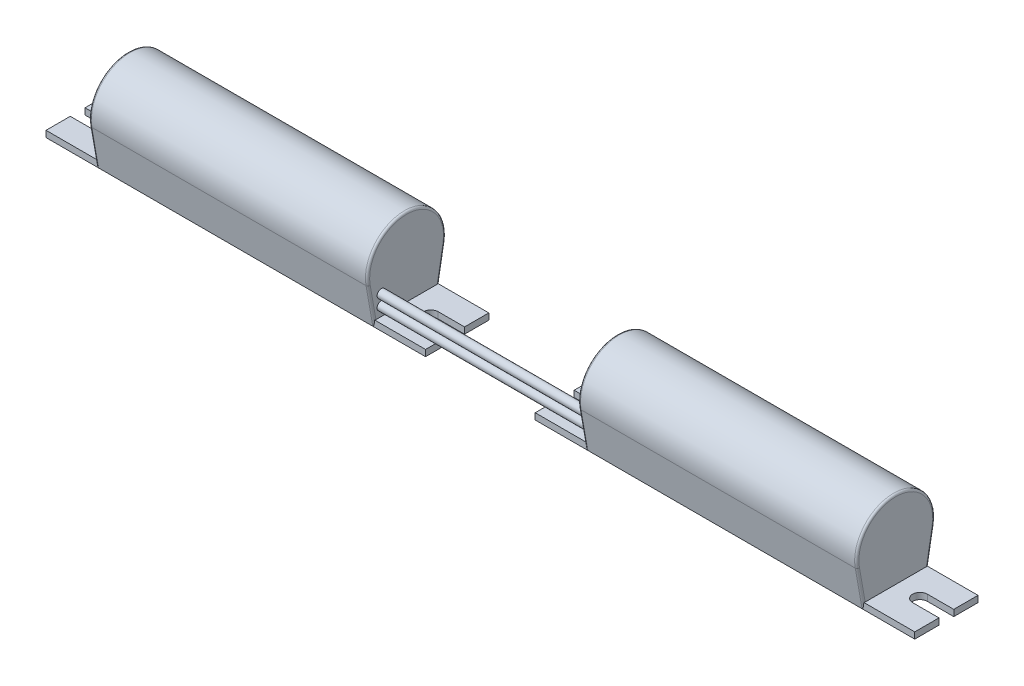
ISO-10303-21;
HEADER;
FILE_DESCRIPTION(('STEP AP214'),'2;1');
FILE_NAME('part.step','',(''),(''),'','','');
FILE_SCHEMA(('AUTOMOTIVE_DESIGN { 1 0 10303 214 1 1 1 1 }'));
ENDSEC;
DATA;
#1=APPLICATION_CONTEXT('core data for automotive mechanical design processes');
#2=APPLICATION_PROTOCOL_DEFINITION('international standard','automotive_design',2000,#1);
#3=PRODUCT_CONTEXT('',#1,'mechanical');
#4=PRODUCT('Part','Part','',(#3));
#5=PRODUCT_RELATED_PRODUCT_CATEGORY('part','',(#4));
#6=PRODUCT_DEFINITION_FORMATION('','',#4);
#7=PRODUCT_DEFINITION_CONTEXT('part definition',#1,'design');
#8=PRODUCT_DEFINITION('design','',#6,#7);
#9=PRODUCT_DEFINITION_SHAPE('','',#8);
#10=(LENGTH_UNIT() NAMED_UNIT(*) SI_UNIT(.MILLI.,.METRE.));
#11=(NAMED_UNIT(*) PLANE_ANGLE_UNIT() SI_UNIT($,.RADIAN.));
#12=(NAMED_UNIT(*) SI_UNIT($,.STERADIAN.) SOLID_ANGLE_UNIT());
#13=UNCERTAINTY_MEASURE_WITH_UNIT(LENGTH_MEASURE(1.E-05),#10,'distance_accuracy_value','');
#14=(GEOMETRIC_REPRESENTATION_CONTEXT(3) GLOBAL_UNCERTAINTY_ASSIGNED_CONTEXT((#13)) GLOBAL_UNIT_ASSIGNED_CONTEXT((#10,
#11,#12)) REPRESENTATION_CONTEXT('',''));
#15=CARTESIAN_POINT('',(0.,0.,0.));
#16=DIRECTION('',(0.,0.,1.));
#17=DIRECTION('',(1.,0.,0.));
#18=AXIS2_PLACEMENT_3D('',#15,#16,#17);
#19=CARTESIAN_POINT('',(-83.,3.75,6.));
#20=DIRECTION('',(1.,0.,0.));
#21=DIRECTION('',(0.,0.,-1.));
#22=AXIS2_PLACEMENT_3D('',#19,#20,#21);
#23=CYLINDRICAL_SURFACE('',#22,1.);
#24=CARTESIAN_POINT('',(-83.,3.75,6.));
#25=DIRECTION('',(1.,0.,0.));
#26=DIRECTION('',(0.,0.,-1.));
#27=AXIS2_PLACEMENT_3D('',#24,#25,#26);
#28=CIRCLE('',#27,1.);
#29=CARTESIAN_POINT('',(-83.,3.75,5.));
#30=VERTEX_POINT('',#29);
#31=EDGE_CURVE('P0_E9',#30,#30,#28,.T.);
#32=ORIENTED_EDGE('',*,*,#31,.T.);
#33=EDGE_LOOP('',(#32));
#34=FACE_BOUND('',#33,.T.);
#35=CARTESIAN_POINT('',(-33.,3.75,6.));
#36=DIRECTION('',(1.,0.,0.));
#37=DIRECTION('',(0.,0.,-1.));
#38=AXIS2_PLACEMENT_3D('',#35,#36,#37);
#39=CIRCLE('',#38,1.);
#40=CARTESIAN_POINT('',(-33.,3.75,5.));
#41=VERTEX_POINT('',#40);
#42=EDGE_CURVE('P0_E16',#41,#41,#39,.T.);
#43=ORIENTED_EDGE('',*,*,#42,.F.);
#44=EDGE_LOOP('',(#43));
#45=FACE_BOUND('',#44,.T.);
#46=ADVANCED_FACE('P0_F13',(#34,#45),#23,.T.);
#47=CARTESIAN_POINT('',(-83.,3.75,6.));
#48=DIRECTION('',(1.,0.,0.));
#49=DIRECTION('',(0.,0.,-1.));
#50=AXIS2_PLACEMENT_3D('',#47,#48,#49);
#51=PLANE('',#50);
#52=ORIENTED_EDGE('',*,*,#31,.F.);
#53=EDGE_LOOP('',(#52));
#54=FACE_BOUND('',#53,.T.);
#55=ADVANCED_FACE('P0_F28',(#54),#51,.F.);
#56=CARTESIAN_POINT('',(-33.,3.75,6.));
#57=DIRECTION('',(1.,0.,0.));
#58=DIRECTION('',(0.,0.,-1.));
#59=AXIS2_PLACEMENT_3D('',#56,#57,#58);
#60=PLANE('',#59);
#61=ORIENTED_EDGE('',*,*,#42,.T.);
#62=EDGE_LOOP('',(#61));
#63=FACE_BOUND('',#62,.T.);
#64=ADVANCED_FACE('P0_F25',(#63),#60,.T.);
#65=CLOSED_SHELL('',(#46,#55,#64));
#66=MANIFOLD_SOLID_BREP('P0_B1',#65);
#67=CARTESIAN_POINT('',(-83.,6.25,6.));
#68=DIRECTION('',(1.,0.,0.));
#69=DIRECTION('',(0.,0.,-1.));
#70=AXIS2_PLACEMENT_3D('',#67,#68,#69);
#71=CYLINDRICAL_SURFACE('',#70,1.);
#72=CARTESIAN_POINT('',(-83.,6.25,6.));
#73=DIRECTION('',(1.,0.,0.));
#74=DIRECTION('',(0.,0.,-1.));
#75=AXIS2_PLACEMENT_3D('',#72,#73,#74);
#76=CIRCLE('',#75,1.);
#77=CARTESIAN_POINT('',(-83.,6.25,5.));
#78=VERTEX_POINT('',#77);
#79=EDGE_CURVE('P1_E10',#78,#78,#76,.T.);
#80=ORIENTED_EDGE('',*,*,#79,.T.);
#81=EDGE_LOOP('',(#80));
#82=FACE_BOUND('',#81,.T.);
#83=CARTESIAN_POINT('',(-33.,6.25,6.));
#84=DIRECTION('',(1.,0.,0.));
#85=DIRECTION('',(0.,0.,-1.));
#86=AXIS2_PLACEMENT_3D('',#83,#84,#85);
#87=CIRCLE('',#86,1.);
#88=CARTESIAN_POINT('',(-33.,6.25,5.));
#89=VERTEX_POINT('',#88);
#90=EDGE_CURVE('P1_E17',#89,#89,#87,.T.);
#91=ORIENTED_EDGE('',*,*,#90,.F.);
#92=EDGE_LOOP('',(#91));
#93=FACE_BOUND('',#92,.T.);
#94=ADVANCED_FACE('P1_F14',(#82,#93),#71,.T.);
#95=CARTESIAN_POINT('',(-83.,6.25,6.));
#96=DIRECTION('',(1.,0.,0.));
#97=DIRECTION('',(0.,0.,-1.));
#98=AXIS2_PLACEMENT_3D('',#95,#96,#97);
#99=PLANE('',#98);
#100=ORIENTED_EDGE('',*,*,#79,.F.);
#101=EDGE_LOOP('',(#100));
#102=FACE_BOUND('',#101,.T.);
#103=ADVANCED_FACE('P1_F29',(#102),#99,.F.);
#104=CARTESIAN_POINT('',(-33.,6.25,6.));
#105=DIRECTION('',(1.,0.,0.));
#106=DIRECTION('',(0.,0.,-1.));
#107=AXIS2_PLACEMENT_3D('',#104,#105,#106);
#108=PLANE('',#107);
#109=ORIENTED_EDGE('',*,*,#90,.T.);
#110=EDGE_LOOP('',(#109));
#111=FACE_BOUND('',#110,.T.);
#112=ADVANCED_FACE('P1_F26',(#111),#108,.T.);
#113=CLOSED_SHELL('',(#94,#103,#112));
#114=MANIFOLD_SOLID_BREP('P1_B1',#113);
#115=CARTESIAN_POINT('',(-116.,0.,0.));
#116=DIRECTION('',(0.,-1.,0.));
#117=DIRECTION('',(0.,0.,-1.));
#118=AXIS2_PLACEMENT_3D('',#115,#116,#117);
#119=PLANE('',#118);
#120=DIRECTION('',(1.,0.,0.));
#121=VECTOR('',#120,1.);
#122=CARTESIAN_POINT('',(-161.,0.,7.5));
#123=LINE('',#122,#121);
#124=CARTESIAN_POINT('',(-83.5,0.,7.5));
#125=VERTEX_POINT('',#124);
#126=CARTESIAN_POINT('',(-71.,0.,7.5));
#127=VERTEX_POINT('',#126);
#128=EDGE_CURVE('P2_E257',#125,#127,#123,.T.);
#129=ORIENTED_EDGE('',*,*,#128,.F.);
#130=DIRECTION('',(0.,0.,-1.));
#131=VECTOR('',#130,1.);
#132=CARTESIAN_POINT('',(-83.5000000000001,0.,0.));
#133=LINE('',#132,#131);
#134=CARTESIAN_POINT('',(-83.5000000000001,0.,-7.5));
#135=VERTEX_POINT('',#134);
#136=EDGE_CURVE('P2_E11',#125,#135,#133,.T.);
#137=ORIENTED_EDGE('',*,*,#136,.T.);
#138=DIRECTION('',(-1.,0.,0.));
#139=VECTOR('',#138,1.);
#140=CARTESIAN_POINT('',(-161.,0.,-7.5));
#141=LINE('',#140,#139);
#142=CARTESIAN_POINT('',(-71.,0.,-7.5));
#143=VERTEX_POINT('',#142);
#144=EDGE_CURVE('P2_E250',#143,#135,#141,.T.);
#145=ORIENTED_EDGE('',*,*,#144,.F.);
#146=DIRECTION('',(0.,0.,-1.));
#147=VECTOR('',#146,1.);
#148=CARTESIAN_POINT('',(-71.,0.,7.5));
#149=LINE('',#148,#147);
#150=CARTESIAN_POINT('',(-71.,0.,-1.75));
#151=VERTEX_POINT('',#150);
#152=EDGE_CURVE('P2_E234',#151,#143,#149,.T.);
#153=ORIENTED_EDGE('',*,*,#152,.F.);
#154=DIRECTION('',(-1.,0.,0.));
#155=VECTOR('',#154,1.);
#156=CARTESIAN_POINT('',(-71.,0.,-1.75));
#157=LINE('',#156,#155);
#158=CARTESIAN_POINT('',(-77.25,0.,-1.75));
#159=VERTEX_POINT('',#158);
#160=EDGE_CURVE('P2_E181',#151,#159,#157,.T.);
#161=ORIENTED_EDGE('',*,*,#160,.T.);
#162=CARTESIAN_POINT('',(-77.25,0.,0.));
#163=DIRECTION('',(0.,1.,0.));
#164=DIRECTION('',(0.,0.,1.));
#165=AXIS2_PLACEMENT_3D('',#162,#163,#164);
#166=CIRCLE('',#165,1.75);
#167=CARTESIAN_POINT('',(-77.25,0.,1.75));
#168=VERTEX_POINT('',#167);
#169=EDGE_CURVE('P2_E200',#159,#168,#166,.T.);
#170=ORIENTED_EDGE('',*,*,#169,.T.);
#171=DIRECTION('',(1.,0.,0.));
#172=VECTOR('',#171,1.);
#173=CARTESIAN_POINT('',(-77.25,0.,1.75));
#174=LINE('',#173,#172);
#175=CARTESIAN_POINT('',(-71.,0.,1.75));
#176=VERTEX_POINT('',#175);
#177=EDGE_CURVE('P2_E187',#168,#176,#174,.T.);
#178=ORIENTED_EDGE('',*,*,#177,.T.);
#179=EDGE_CURVE('P2_E246',#127,#176,#149,.T.);
#180=ORIENTED_EDGE('',*,*,#179,.F.);
#181=EDGE_LOOP('',(#129,#137,#145,#153,#161,#170,#178,#180));
#182=FACE_BOUND('',#181,.T.);
#183=ADVANCED_FACE('P2_F16',(#182),#119,.T.);
#184=CARTESIAN_POINT('',(-148.5,0.,-7.5));
#185=VERTEX_POINT('',#184);
#186=CARTESIAN_POINT('',(-161.,0.,-7.5));
#187=VERTEX_POINT('',#186);
#188=EDGE_CURVE('P2_E249',#185,#187,#141,.T.);
#189=ORIENTED_EDGE('',*,*,#188,.F.);
#190=DIRECTION('',(0.,0.,1.));
#191=VECTOR('',#190,1.);
#192=CARTESIAN_POINT('',(-148.5,0.,0.));
#193=LINE('',#192,#191);
#194=CARTESIAN_POINT('',(-148.5,0.,7.5));
#195=VERTEX_POINT('',#194);
#196=EDGE_CURVE('P2_E25',#185,#195,#193,.T.);
#197=ORIENTED_EDGE('',*,*,#196,.T.);
#198=CARTESIAN_POINT('',(-161.,0.,7.5));
#199=VERTEX_POINT('',#198);
#200=EDGE_CURVE('P2_E258',#199,#195,#123,.T.);
#201=ORIENTED_EDGE('',*,*,#200,.F.);
#202=DIRECTION('',(0.,0.,1.));
#203=VECTOR('',#202,1.);
#204=CARTESIAN_POINT('',(-161.,0.,7.5));
#205=LINE('',#204,#203);
#206=CARTESIAN_POINT('',(-161.,0.,1.75));
#207=VERTEX_POINT('',#206);
#208=EDGE_CURVE('P2_E253',#207,#199,#205,.T.);
#209=ORIENTED_EDGE('',*,*,#208,.F.);
#210=DIRECTION('',(1.,0.,0.));
#211=VECTOR('',#210,1.);
#212=CARTESIAN_POINT('',(-154.75,0.,1.75));
#213=LINE('',#212,#211);
#214=CARTESIAN_POINT('',(-154.75,0.,1.75));
#215=VERTEX_POINT('',#214);
#216=EDGE_CURVE('P2_E188',#207,#215,#213,.T.);
#217=ORIENTED_EDGE('',*,*,#216,.T.);
#218=CARTESIAN_POINT('',(-154.75,0.,0.));
#219=DIRECTION('',(0.,1.,0.));
#220=DIRECTION('',(0.,0.,-1.));
#221=AXIS2_PLACEMENT_3D('',#218,#219,#220);
#222=CIRCLE('',#221,1.75);
#223=CARTESIAN_POINT('',(-154.75,0.,-1.75));
#224=VERTEX_POINT('',#223);
#225=EDGE_CURVE('P2_E221',#215,#224,#222,.T.);
#226=ORIENTED_EDGE('',*,*,#225,.T.);
#227=DIRECTION('',(-1.,0.,0.));
#228=VECTOR('',#227,1.);
#229=CARTESIAN_POINT('',(-161.,0.,-1.75));
#230=LINE('',#229,#228);
#231=CARTESIAN_POINT('',(-161.,0.,-1.75));
#232=VERTEX_POINT('',#231);
#233=EDGE_CURVE('P2_E214',#224,#232,#230,.T.);
#234=ORIENTED_EDGE('',*,*,#233,.T.);
#235=EDGE_CURVE('P2_E254',#187,#232,#205,.T.);
#236=ORIENTED_EDGE('',*,*,#235,.F.);
#237=EDGE_LOOP('',(#189,#197,#201,#209,#217,#226,#234,#236));
#238=FACE_BOUND('',#237,.T.);
#239=ADVANCED_FACE('P2_F331',(#238),#119,.T.);
#240=CARTESIAN_POINT('',(-116.,1.5,0.));
#241=DIRECTION('',(0.,-1.,0.));
#242=DIRECTION('',(0.,0.,-1.));
#243=AXIS2_PLACEMENT_3D('',#240,#241,#242);
#244=PLANE('',#243);
#245=DIRECTION('',(0.,0.,1.));
#246=VECTOR('',#245,1.);
#247=CARTESIAN_POINT('',(-149.,1.5,0.));
#248=LINE('',#247,#246);
#249=CARTESIAN_POINT('',(-149.,1.5,-7.25634154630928));
#250=VERTEX_POINT('',#249);
#251=CARTESIAN_POINT('',(-149.,1.5,7.25634154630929));
#252=VERTEX_POINT('',#251);
#253=EDGE_CURVE('P2_E358',#250,#252,#248,.T.);
#254=ORIENTED_EDGE('',*,*,#253,.F.);
#255=CARTESIAN_POINT('',(-148.5,1.5,-7.25634154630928));
#256=DIRECTION('',(0.,-1.,0.));
#257=DIRECTION('',(0.,0.,-1.));
#258=AXIS2_PLACEMENT_3D('',#255,#256,#257);
#259=ELLIPSE('',#258,0.507686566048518,0.5);
#260=CARTESIAN_POINT('',(-148.938651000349,1.5,-7.5));
#261=VERTEX_POINT('',#260);
#262=EDGE_CURVE('P2_E305',#250,#261,#259,.T.);
#263=ORIENTED_EDGE('',*,*,#262,.T.);
#264=DIRECTION('',(-1.,0.,0.));
#265=VECTOR('',#264,1.);
#266=CARTESIAN_POINT('',(-161.,1.5,-7.5));
#267=LINE('',#266,#265);
#268=CARTESIAN_POINT('',(-161.,1.5,-7.5));
#269=VERTEX_POINT('',#268);
#270=EDGE_CURVE('P2_E59',#261,#269,#267,.T.);
#271=ORIENTED_EDGE('',*,*,#270,.T.);
#272=DIRECTION('',(0.,0.,1.));
#273=VECTOR('',#272,1.);
#274=CARTESIAN_POINT('',(-161.,1.5,7.5));
#275=LINE('',#274,#273);
#276=CARTESIAN_POINT('',(-161.,1.5,-1.75));
#277=VERTEX_POINT('',#276);
#278=EDGE_CURVE('P2_E240',#269,#277,#275,.T.);
#279=ORIENTED_EDGE('',*,*,#278,.T.);
#280=DIRECTION('',(-1.,0.,0.));
#281=VECTOR('',#280,1.);
#282=CARTESIAN_POINT('',(-161.,1.5,-1.75));
#283=LINE('',#282,#281);
#284=CARTESIAN_POINT('',(-154.75,1.5,-1.75));
#285=VERTEX_POINT('',#284);
#286=EDGE_CURVE('P2_E216',#285,#277,#283,.T.);
#287=ORIENTED_EDGE('',*,*,#286,.F.);
#288=CARTESIAN_POINT('',(-154.75,1.5,0.));
#289=DIRECTION('',(0.,1.,0.));
#290=DIRECTION('',(0.,0.,-1.));
#291=AXIS2_PLACEMENT_3D('',#288,#289,#290);
#292=CIRCLE('',#291,1.75);
#293=CARTESIAN_POINT('',(-154.75,1.5,1.75));
#294=VERTEX_POINT('',#293);
#295=EDGE_CURVE('P2_E213',#294,#285,#292,.T.);
#296=ORIENTED_EDGE('',*,*,#295,.F.);
#297=DIRECTION('',(1.,0.,0.));
#298=VECTOR('',#297,1.);
#299=CARTESIAN_POINT('',(-154.75,1.5,1.75));
#300=LINE('',#299,#298);
#301=CARTESIAN_POINT('',(-161.,1.5,1.75));
#302=VERTEX_POINT('',#301);
#303=EDGE_CURVE('P2_E211',#302,#294,#300,.T.);
#304=ORIENTED_EDGE('',*,*,#303,.F.);
#305=CARTESIAN_POINT('',(-161.,1.5,7.5));
#306=VERTEX_POINT('',#305);
#307=EDGE_CURVE('P2_E239',#302,#306,#275,.T.);
#308=ORIENTED_EDGE('',*,*,#307,.T.);
#309=DIRECTION('',(1.,0.,0.));
#310=VECTOR('',#309,1.);
#311=CARTESIAN_POINT('',(-161.,1.5,7.5));
#312=LINE('',#311,#310);
#313=CARTESIAN_POINT('',(-148.938651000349,1.5,7.5));
#314=VERTEX_POINT('',#313);
#315=EDGE_CURVE('P2_E33',#306,#314,#312,.T.);
#316=ORIENTED_EDGE('',*,*,#315,.T.);
#317=CARTESIAN_POINT('',(-148.5,1.5,7.25634154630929));
#318=DIRECTION('',(0.,-1.,0.));
#319=DIRECTION('',(0.,0.,-1.));
#320=AXIS2_PLACEMENT_3D('',#317,#318,#319);
#321=ELLIPSE('',#320,0.507686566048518,0.5);
#322=EDGE_CURVE('P2_E317',#314,#252,#321,.T.);
#323=ORIENTED_EDGE('',*,*,#322,.T.);
#324=EDGE_LOOP('',(#254,#263,#271,#279,#287,#296,#304,#308,#316,#323));
#325=FACE_BOUND('',#324,.T.);
#326=ADVANCED_FACE('P2_F357',(#325),#244,.F.);
#327=CARTESIAN_POINT('',(-161.,1.5,-7.5));
#328=DIRECTION('',(0.,0.,1.));
#329=DIRECTION('',(1.,0.,0.));
#330=AXIS2_PLACEMENT_3D('',#327,#328,#329);
#331=PLANE('',#330);
#332=ORIENTED_EDGE('',*,*,#270,.F.);
#333=CARTESIAN_POINT('',(-148.5,2.88427562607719,-7.5));
#334=DIRECTION('',(0.,0.,1.));
#335=DIRECTION('',(0.,1.,0.));
#336=AXIS2_PLACEMENT_3D('',#333,#334,#335);
#337=ELLIPSE('',#336,2.88427562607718,0.5);
#338=EDGE_CURVE('P2_E307',#261,#185,#337,.T.);
#339=ORIENTED_EDGE('',*,*,#338,.T.);
#340=ORIENTED_EDGE('',*,*,#188,.T.);
#341=DIRECTION('',(0.,-1.,0.));
#342=VECTOR('',#341,1.);
#343=CARTESIAN_POINT('',(-161.,1.5,-7.5));
#344=LINE('',#343,#342);
#345=EDGE_CURVE('P2_E266',#269,#187,#344,.T.);
#346=ORIENTED_EDGE('',*,*,#345,.F.);
#347=EDGE_LOOP('',(#332,#339,#340,#346));
#348=FACE_BOUND('',#347,.T.);
#349=ADVANCED_FACE('P2_F440',(#348),#331,.F.);
#350=CARTESIAN_POINT('',(-161.,1.5,7.5));
#351=DIRECTION('',(0.,0.,-1.));
#352=DIRECTION('',(-1.,0.,0.));
#353=AXIS2_PLACEMENT_3D('',#350,#351,#352);
#354=PLANE('',#353);
#355=ORIENTED_EDGE('',*,*,#200,.T.);
#356=CARTESIAN_POINT('',(-148.5,2.88427562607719,7.5));
#357=DIRECTION('',(0.,0.,-1.));
#358=DIRECTION('',(0.,-1.,0.));
#359=AXIS2_PLACEMENT_3D('',#356,#357,#358);
#360=ELLIPSE('',#359,2.88427562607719,0.5);
#361=EDGE_CURVE('P2_E315',#195,#314,#360,.T.);
#362=ORIENTED_EDGE('',*,*,#361,.T.);
#363=ORIENTED_EDGE('',*,*,#315,.F.);
#364=DIRECTION('',(0.,-1.,0.));
#365=VECTOR('',#364,1.);
#366=CARTESIAN_POINT('',(-161.,1.5,7.5));
#367=LINE('',#366,#365);
#368=EDGE_CURVE('P2_E263',#306,#199,#367,.T.);
#369=ORIENTED_EDGE('',*,*,#368,.T.);
#370=EDGE_LOOP('',(#355,#362,#363,#369));
#371=FACE_BOUND('',#370,.T.);
#372=ADVANCED_FACE('P2_F336',(#371),#354,.F.);
#373=CARTESIAN_POINT('',(-71.,1.5,-7.5));
#374=VERTEX_POINT('',#373);
#375=CARTESIAN_POINT('',(-83.0613489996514,1.5,-7.5));
#376=VERTEX_POINT('',#375);
#377=EDGE_CURVE('P2_E237',#374,#376,#267,.T.);
#378=ORIENTED_EDGE('',*,*,#377,.T.);
#379=CARTESIAN_POINT('',(-83.5,1.5,-7.25634154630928));
#380=DIRECTION('',(0.,-1.,0.));
#381=DIRECTION('',(0.,0.,1.));
#382=AXIS2_PLACEMENT_3D('',#379,#380,#381);
#383=ELLIPSE('',#382,0.507686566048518,0.5);
#384=CARTESIAN_POINT('',(-83.,1.5,-7.25634154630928));
#385=VERTEX_POINT('',#384);
#386=EDGE_CURVE('P2_E303',#376,#385,#383,.T.);
#387=ORIENTED_EDGE('',*,*,#386,.T.);
#388=DIRECTION('',(0.,0.,1.));
#389=VECTOR('',#388,1.);
#390=CARTESIAN_POINT('',(-83.,1.5,0.));
#391=LINE('',#390,#389);
#392=CARTESIAN_POINT('',(-83.,1.5,7.25634154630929));
#393=VERTEX_POINT('',#392);
#394=EDGE_CURVE('P2_E202',#385,#393,#391,.T.);
#395=ORIENTED_EDGE('',*,*,#394,.T.);
#396=CARTESIAN_POINT('',(-83.5,1.5,7.25634154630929));
#397=DIRECTION('',(0.,-1.,0.));
#398=DIRECTION('',(0.,0.,1.));
#399=AXIS2_PLACEMENT_3D('',#396,#397,#398);
#400=ELLIPSE('',#399,0.507686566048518,0.5);
#401=CARTESIAN_POINT('',(-83.0613489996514,1.5,7.5));
#402=VERTEX_POINT('',#401);
#403=EDGE_CURVE('P2_E309',#393,#402,#400,.T.);
#404=ORIENTED_EDGE('',*,*,#403,.T.);
#405=CARTESIAN_POINT('',(-71.,1.5,7.5));
#406=VERTEX_POINT('',#405);
#407=EDGE_CURVE('P2_E243',#402,#406,#312,.T.);
#408=ORIENTED_EDGE('',*,*,#407,.T.);
#409=DIRECTION('',(0.,0.,-1.));
#410=VECTOR('',#409,1.);
#411=CARTESIAN_POINT('',(-71.,1.5,7.5));
#412=LINE('',#411,#410);
#413=CARTESIAN_POINT('',(-71.,1.5,1.75));
#414=VERTEX_POINT('',#413);
#415=EDGE_CURVE('P2_E194',#406,#414,#412,.T.);
#416=ORIENTED_EDGE('',*,*,#415,.T.);
#417=DIRECTION('',(1.,0.,0.));
#418=VECTOR('',#417,1.);
#419=CARTESIAN_POINT('',(-77.25,1.5,1.75));
#420=LINE('',#419,#418);
#421=CARTESIAN_POINT('',(-77.25,1.5,1.75));
#422=VERTEX_POINT('',#421);
#423=EDGE_CURVE('P2_E180',#422,#414,#420,.T.);
#424=ORIENTED_EDGE('',*,*,#423,.F.);
#425=CARTESIAN_POINT('',(-77.25,1.5,0.));
#426=DIRECTION('',(0.,1.,0.));
#427=DIRECTION('',(0.,0.,1.));
#428=AXIS2_PLACEMENT_3D('',#425,#426,#427);
#429=CIRCLE('',#428,1.75);
#430=CARTESIAN_POINT('',(-77.25,1.5,-1.75));
#431=VERTEX_POINT('',#430);
#432=EDGE_CURVE('P2_E170',#431,#422,#429,.T.);
#433=ORIENTED_EDGE('',*,*,#432,.F.);
#434=DIRECTION('',(-1.,0.,0.));
#435=VECTOR('',#434,1.);
#436=CARTESIAN_POINT('',(-71.,1.5,-1.75));
#437=LINE('',#436,#435);
#438=CARTESIAN_POINT('',(-71.,1.5,-1.75));
#439=VERTEX_POINT('',#438);
#440=EDGE_CURVE('P2_E195',#439,#431,#437,.T.);
#441=ORIENTED_EDGE('',*,*,#440,.F.);
#442=EDGE_CURVE('P2_E236',#439,#374,#412,.T.);
#443=ORIENTED_EDGE('',*,*,#442,.T.);
#444=EDGE_LOOP('',(#378,#387,#395,#404,#408,#416,#424,#433,#441,#443));
#445=FACE_BOUND('',#444,.T.);
#446=ADVANCED_FACE('P2_F192',(#445),#244,.F.);
#447=ORIENTED_EDGE('',*,*,#136,.F.);
#448=DIRECTION('',(-1.,0.,0.));
#449=VECTOR('',#448,1.);
#450=CARTESIAN_POINT('',(-83.,0.,7.5));
#451=LINE('',#450,#449);
#452=EDGE_CURVE('P2_E345',#125,#195,#451,.T.);
#453=ORIENTED_EDGE('',*,*,#452,.T.);
#454=ORIENTED_EDGE('',*,*,#196,.F.);
#455=DIRECTION('',(-1.,0.,0.));
#456=VECTOR('',#455,1.);
#457=CARTESIAN_POINT('',(-83.,0.,-7.5));
#458=LINE('',#457,#456);
#459=EDGE_CURVE('P2_E352',#135,#185,#458,.T.);
#460=ORIENTED_EDGE('',*,*,#459,.F.);
#461=EDGE_LOOP('',(#447,#453,#454,#460));
#462=FACE_BOUND('',#461,.T.);
#463=ADVANCED_FACE('P2_F350',(#462),#119,.T.);
#464=CARTESIAN_POINT('',(-71.,1.5,7.5));
#465=DIRECTION('',(-1.,0.,0.));
#466=DIRECTION('',(0.,0.,1.));
#467=AXIS2_PLACEMENT_3D('',#464,#465,#466);
#468=PLANE('',#467);
#469=DIRECTION('',(0.,-1.,0.));
#470=VECTOR('',#469,1.);
#471=CARTESIAN_POINT('',(-71.,1.5,1.75));
#472=LINE('',#471,#470);
#473=EDGE_CURVE('P2_E189',#414,#176,#472,.T.);
#474=ORIENTED_EDGE('',*,*,#473,.F.);
#475=ORIENTED_EDGE('',*,*,#415,.F.);
#476=DIRECTION('',(0.,-1.,0.));
#477=VECTOR('',#476,1.);
#478=CARTESIAN_POINT('',(-71.,1.5,7.5));
#479=LINE('',#478,#477);
#480=EDGE_CURVE('P2_E245',#406,#127,#479,.T.);
#481=ORIENTED_EDGE('',*,*,#480,.T.);
#482=ORIENTED_EDGE('',*,*,#179,.T.);
#483=EDGE_LOOP('',(#474,#475,#481,#482));
#484=FACE_BOUND('',#483,.T.);
#485=ADVANCED_FACE('P2_F408',(#484),#468,.F.);
#486=DIRECTION('',(0.,-1.,0.));
#487=VECTOR('',#486,1.);
#488=CARTESIAN_POINT('',(-71.,1.5,-1.75));
#489=LINE('',#488,#487);
#490=EDGE_CURVE('P2_E207',#439,#151,#489,.T.);
#491=ORIENTED_EDGE('',*,*,#490,.T.);
#492=ORIENTED_EDGE('',*,*,#152,.T.);
#493=DIRECTION('',(0.,-1.,0.));
#494=VECTOR('',#493,1.);
#495=CARTESIAN_POINT('',(-71.,1.5,-7.5));
#496=LINE('',#495,#494);
#497=EDGE_CURVE('P2_E269',#374,#143,#496,.T.);
#498=ORIENTED_EDGE('',*,*,#497,.F.);
#499=ORIENTED_EDGE('',*,*,#442,.F.);
#500=EDGE_LOOP('',(#491,#492,#498,#499));
#501=FACE_BOUND('',#500,.T.);
#502=ADVANCED_FACE('P2_F412',(#501),#468,.F.);
#503=CARTESIAN_POINT('',(-161.,1.5,7.5));
#504=DIRECTION('',(1.,0.,0.));
#505=DIRECTION('',(0.,0.,-1.));
#506=AXIS2_PLACEMENT_3D('',#503,#504,#505);
#507=PLANE('',#506);
#508=DIRECTION('',(0.,-1.,0.));
#509=VECTOR('',#508,1.);
#510=CARTESIAN_POINT('',(-161.,1.5,1.75));
#511=LINE('',#510,#509);
#512=EDGE_CURVE('P2_E231',#302,#207,#511,.T.);
#513=ORIENTED_EDGE('',*,*,#512,.T.);
#514=ORIENTED_EDGE('',*,*,#208,.T.);
#515=ORIENTED_EDGE('',*,*,#368,.F.);
#516=ORIENTED_EDGE('',*,*,#307,.F.);
#517=EDGE_LOOP('',(#513,#514,#515,#516));
#518=FACE_BOUND('',#517,.T.);
#519=ADVANCED_FACE('P2_F414',(#518),#507,.F.);
#520=DIRECTION('',(0.,-1.,0.));
#521=VECTOR('',#520,1.);
#522=CARTESIAN_POINT('',(-161.,1.5,-1.75));
#523=LINE('',#522,#521);
#524=EDGE_CURVE('P2_E218',#277,#232,#523,.T.);
#525=ORIENTED_EDGE('',*,*,#524,.F.);
#526=ORIENTED_EDGE('',*,*,#278,.F.);
#527=ORIENTED_EDGE('',*,*,#345,.T.);
#528=ORIENTED_EDGE('',*,*,#235,.T.);
#529=EDGE_LOOP('',(#525,#526,#527,#528));
#530=FACE_BOUND('',#529,.T.);
#531=ADVANCED_FACE('P2_F421',(#530),#507,.F.);
#532=ORIENTED_EDGE('',*,*,#144,.T.);
#533=CARTESIAN_POINT('',(-83.5,2.88427562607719,-7.5));
#534=DIRECTION('',(0.,0.,1.));
#535=DIRECTION('',(0.,-1.,0.));
#536=AXIS2_PLACEMENT_3D('',#533,#534,#535);
#537=ELLIPSE('',#536,2.88427562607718,0.5);
#538=EDGE_CURVE('P2_E300',#135,#376,#537,.T.);
#539=ORIENTED_EDGE('',*,*,#538,.T.);
#540=ORIENTED_EDGE('',*,*,#377,.F.);
#541=ORIENTED_EDGE('',*,*,#497,.T.);
#542=EDGE_LOOP('',(#532,#539,#540,#541));
#543=FACE_BOUND('',#542,.T.);
#544=ADVANCED_FACE('P2_F397',(#543),#331,.F.);
#545=ORIENTED_EDGE('',*,*,#407,.F.);
#546=CARTESIAN_POINT('',(-83.5,2.88427562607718,7.5));
#547=DIRECTION('',(0.,0.,-1.));
#548=DIRECTION('',(0.,1.,0.));
#549=AXIS2_PLACEMENT_3D('',#546,#547,#548);
#550=ELLIPSE('',#549,2.88427562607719,0.5);
#551=EDGE_CURVE('P2_E312',#402,#125,#550,.T.);
#552=ORIENTED_EDGE('',*,*,#551,.T.);
#553=ORIENTED_EDGE('',*,*,#128,.T.);
#554=ORIENTED_EDGE('',*,*,#480,.F.);
#555=EDGE_LOOP('',(#545,#552,#553,#554));
#556=FACE_BOUND('',#555,.T.);
#557=ADVANCED_FACE('P2_F404',(#556),#354,.F.);
#558=CARTESIAN_POINT('',(-154.75,1.5,1.75));
#559=DIRECTION('',(0.,0.,-1.));
#560=DIRECTION('',(-1.,0.,0.));
#561=AXIS2_PLACEMENT_3D('',#558,#559,#560);
#562=PLANE('',#561);
#563=ORIENTED_EDGE('',*,*,#216,.F.);
#564=ORIENTED_EDGE('',*,*,#512,.F.);
#565=ORIENTED_EDGE('',*,*,#303,.T.);
#566=DIRECTION('',(0.,-1.,0.));
#567=VECTOR('',#566,1.);
#568=CARTESIAN_POINT('',(-154.75,1.5,1.75));
#569=LINE('',#568,#567);
#570=EDGE_CURVE('P2_E229',#294,#215,#569,.T.);
#571=ORIENTED_EDGE('',*,*,#570,.T.);
#572=EDGE_LOOP('',(#563,#564,#565,#571));
#573=FACE_BOUND('',#572,.T.);
#574=ADVANCED_FACE('P2_F453',(#573),#562,.T.);
#575=CARTESIAN_POINT('',(-154.75,1.5,0.));
#576=DIRECTION('',(0.,-1.,0.));
#577=DIRECTION('',(0.,0.,-1.));
#578=AXIS2_PLACEMENT_3D('',#575,#576,#577);
#579=CYLINDRICAL_SURFACE('',#578,1.75);
#580=ORIENTED_EDGE('',*,*,#225,.F.);
#581=ORIENTED_EDGE('',*,*,#570,.F.);
#582=ORIENTED_EDGE('',*,*,#295,.T.);
#583=DIRECTION('',(0.,-1.,0.));
#584=VECTOR('',#583,1.);
#585=CARTESIAN_POINT('',(-154.75,1.5,-1.75));
#586=LINE('',#585,#584);
#587=EDGE_CURVE('P2_E227',#285,#224,#586,.T.);
#588=ORIENTED_EDGE('',*,*,#587,.T.);
#589=EDGE_LOOP('',(#580,#581,#582,#588));
#590=FACE_BOUND('',#589,.T.);
#591=ADVANCED_FACE('P2_F468',(#590),#579,.F.);
#592=CARTESIAN_POINT('',(-161.,1.5,-1.75));
#593=DIRECTION('',(0.,0.,1.));
#594=DIRECTION('',(1.,0.,0.));
#595=AXIS2_PLACEMENT_3D('',#592,#593,#594);
#596=PLANE('',#595);
#597=ORIENTED_EDGE('',*,*,#233,.F.);
#598=ORIENTED_EDGE('',*,*,#587,.F.);
#599=ORIENTED_EDGE('',*,*,#286,.T.);
#600=ORIENTED_EDGE('',*,*,#524,.T.);
#601=EDGE_LOOP('',(#597,#598,#599,#600));
#602=FACE_BOUND('',#601,.T.);
#603=ADVANCED_FACE('P2_F466',(#602),#596,.T.);
#604=CARTESIAN_POINT('',(-77.25,1.5,0.));
#605=DIRECTION('',(0.,-1.,0.));
#606=DIRECTION('',(0.,0.,-1.));
#607=AXIS2_PLACEMENT_3D('',#604,#605,#606);
#608=CYLINDRICAL_SURFACE('',#607,1.75);
#609=ORIENTED_EDGE('',*,*,#169,.F.);
#610=DIRECTION('',(0.,-1.,0.));
#611=VECTOR('',#610,1.);
#612=CARTESIAN_POINT('',(-77.25,1.5,-1.75));
#613=LINE('',#612,#611);
#614=EDGE_CURVE('P2_E176',#431,#159,#613,.T.);
#615=ORIENTED_EDGE('',*,*,#614,.F.);
#616=ORIENTED_EDGE('',*,*,#432,.T.);
#617=DIRECTION('',(0.,-1.,0.));
#618=VECTOR('',#617,1.);
#619=CARTESIAN_POINT('',(-77.25,1.5,1.75));
#620=LINE('',#619,#618);
#621=EDGE_CURVE('P2_E174',#422,#168,#620,.T.);
#622=ORIENTED_EDGE('',*,*,#621,.T.);
#623=EDGE_LOOP('',(#609,#615,#616,#622));
#624=FACE_BOUND('',#623,.T.);
#625=ADVANCED_FACE('P2_F173',(#624),#608,.F.);
#626=CARTESIAN_POINT('',(-77.25,1.5,1.75));
#627=DIRECTION('',(0.,0.,-1.));
#628=DIRECTION('',(-1.,0.,0.));
#629=AXIS2_PLACEMENT_3D('',#626,#627,#628);
#630=PLANE('',#629);
#631=ORIENTED_EDGE('',*,*,#177,.F.);
#632=ORIENTED_EDGE('',*,*,#621,.F.);
#633=ORIENTED_EDGE('',*,*,#423,.T.);
#634=ORIENTED_EDGE('',*,*,#473,.T.);
#635=EDGE_LOOP('',(#631,#632,#633,#634));
#636=FACE_BOUND('',#635,.T.);
#637=ADVANCED_FACE('P2_F184',(#636),#630,.T.);
#638=CARTESIAN_POINT('',(-71.,1.5,-1.75));
#639=DIRECTION('',(0.,0.,1.));
#640=DIRECTION('',(1.,0.,0.));
#641=AXIS2_PLACEMENT_3D('',#638,#639,#640);
#642=PLANE('',#641);
#643=ORIENTED_EDGE('',*,*,#160,.F.);
#644=ORIENTED_EDGE('',*,*,#490,.F.);
#645=ORIENTED_EDGE('',*,*,#440,.T.);
#646=ORIENTED_EDGE('',*,*,#614,.T.);
#647=EDGE_LOOP('',(#643,#644,#645,#646));
#648=FACE_BOUND('',#647,.T.);
#649=ADVANCED_FACE('P2_F410',(#648),#642,.T.);
#650=CARTESIAN_POINT('',(-83.,10.75,0.));
#651=DIRECTION('',(1.,0.,0.));
#652=DIRECTION('',(0.,0.,-1.));
#653=AXIS2_PLACEMENT_3D('',#650,#651,#652);
#654=PLANE('',#653);
#655=ORIENTED_EDGE('',*,*,#394,.F.);
#656=DIRECTION('',(0.,0.984859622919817,-0.173353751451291));
#657=VECTOR('',#656,1.);
#658=CARTESIAN_POINT('',(-83.,9.2331546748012,-8.6175217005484));
#659=LINE('',#658,#657);
#660=CARTESIAN_POINT('',(-83.,9.2331546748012,-8.6175217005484));
#661=VERTEX_POINT('',#660);
#662=EDGE_CURVE('P2_E276',#385,#661,#659,.T.);
#663=ORIENTED_EDGE('',*,*,#662,.T.);
#664=CARTESIAN_POINT('',(-83.,10.75,0.));
#665=DIRECTION('',(1.,0.,0.));
#666=DIRECTION('',(0.,0.,-1.));
#667=AXIS2_PLACEMENT_3D('',#664,#665,#666);
#668=CIRCLE('',#667,8.75);
#669=CARTESIAN_POINT('',(-83.,9.23315467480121,8.6175217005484));
#670=VERTEX_POINT('',#669);
#671=EDGE_CURVE('P2_E274',#661,#670,#668,.T.);
#672=ORIENTED_EDGE('',*,*,#671,.T.);
#673=DIRECTION('',(0.,-0.984859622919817,-0.173353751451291));
#674=VECTOR('',#673,1.);
#675=CARTESIAN_POINT('',(-83.,0.0866768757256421,7.00757018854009));
#676=LINE('',#675,#674);
#677=EDGE_CURVE('P2_E272',#670,#393,#676,.T.);
#678=ORIENTED_EDGE('',*,*,#677,.T.);
#679=EDGE_LOOP('',(#655,#663,#672,#678));
#680=FACE_BOUND('',#679,.T.);
#681=ADVANCED_FACE('P2_F391',(#680),#654,.T.);
#682=CARTESIAN_POINT('',(-149.,10.75,0.));
#683=DIRECTION('',(1.,0.,0.));
#684=DIRECTION('',(0.,0.,-1.));
#685=AXIS2_PLACEMENT_3D('',#682,#683,#684);
#686=PLANE('',#685);
#687=CARTESIAN_POINT('',(-149.,10.75,0.));
#688=DIRECTION('',(1.,0.,0.));
#689=DIRECTION('',(0.,0.,-1.));
#690=AXIS2_PLACEMENT_3D('',#687,#688,#689);
#691=CIRCLE('',#690,8.75);
#692=CARTESIAN_POINT('',(-149.,9.23315467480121,8.6175217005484));
#693=VERTEX_POINT('',#692);
#694=CARTESIAN_POINT('',(-149.,9.2331546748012,-8.6175217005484));
#695=VERTEX_POINT('',#694);
#696=EDGE_CURVE('P2_E291',#693,#695,#691,.F.);
#697=ORIENTED_EDGE('',*,*,#696,.T.);
#698=DIRECTION('',(0.,0.984859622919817,-0.173353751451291));
#699=VECTOR('',#698,1.);
#700=CARTESIAN_POINT('',(-149.,9.23315467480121,-8.6175217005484));
#701=LINE('',#700,#699);
#702=EDGE_CURVE('P2_E293',#695,#250,#701,.F.);
#703=ORIENTED_EDGE('',*,*,#702,.T.);
#704=ORIENTED_EDGE('',*,*,#253,.T.);
#705=DIRECTION('',(0.,-0.984859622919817,-0.173353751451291));
#706=VECTOR('',#705,1.);
#707=CARTESIAN_POINT('',(-149.,9.23315467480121,8.6175217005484));
#708=LINE('',#707,#706);
#709=EDGE_CURVE('P2_E289',#252,#693,#708,.F.);
#710=ORIENTED_EDGE('',*,*,#709,.T.);
#711=EDGE_LOOP('',(#697,#703,#704,#710));
#712=FACE_BOUND('',#711,.T.);
#713=ADVANCED_FACE('P2_F361',(#712),#686,.F.);
#714=CARTESIAN_POINT('',(-83.,10.75,0.));
#715=DIRECTION('',(-1.,0.,0.));
#716=DIRECTION('',(0.,0.,1.));
#717=AXIS2_PLACEMENT_3D('',#714,#715,#716);
#718=CYLINDRICAL_SURFACE('',#717,9.25);
#719=DIRECTION('',(-1.,0.,0.));
#720=VECTOR('',#719,1.);
#721=CARTESIAN_POINT('',(-83.,9.14647779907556,9.10995151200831));
#722=LINE('',#721,#720);
#723=CARTESIAN_POINT('',(-83.5,9.14647779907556,9.10995151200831));
#724=VERTEX_POINT('',#723);
#725=CARTESIAN_POINT('',(-148.5,9.14647779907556,9.10995151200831));
#726=VERTEX_POINT('',#725);
#727=EDGE_CURVE('P2_E347',#724,#726,#722,.T.);
#728=ORIENTED_EDGE('',*,*,#727,.F.);
#729=CARTESIAN_POINT('',(-83.5,10.75,0.));
#730=DIRECTION('',(1.,0.,0.));
#731=DIRECTION('',(0.,0.,-1.));
#732=AXIS2_PLACEMENT_3D('',#729,#730,#731);
#733=CIRCLE('',#732,9.25);
#734=CARTESIAN_POINT('',(-83.5,9.14647779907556,-9.10995151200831));
#735=VERTEX_POINT('',#734);
#736=EDGE_CURVE('P2_E287',#724,#735,#733,.F.);
#737=ORIENTED_EDGE('',*,*,#736,.T.);
#738=DIRECTION('',(-1.,0.,0.));
#739=VECTOR('',#738,1.);
#740=CARTESIAN_POINT('',(-83.,9.14647779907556,-9.10995151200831));
#741=LINE('',#740,#739);
#742=CARTESIAN_POINT('',(-148.5,9.14647779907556,-9.10995151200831));
#743=VERTEX_POINT('',#742);
#744=EDGE_CURVE('P2_E325',#735,#743,#741,.T.);
#745=ORIENTED_EDGE('',*,*,#744,.T.);
#746=CARTESIAN_POINT('',(-148.5,10.75,0.));
#747=DIRECTION('',(1.,0.,0.));
#748=DIRECTION('',(0.,0.,-1.));
#749=AXIS2_PLACEMENT_3D('',#746,#747,#748);
#750=CIRCLE('',#749,9.25);
#751=EDGE_CURVE('P2_E285',#743,#726,#750,.T.);
#752=ORIENTED_EDGE('',*,*,#751,.T.);
#753=EDGE_LOOP('',(#728,#737,#745,#752));
#754=FACE_BOUND('',#753,.T.);
#755=ADVANCED_FACE('P2_F371',(#754),#718,.T.);
#756=CARTESIAN_POINT('',(-83.,9.14647779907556,9.10995151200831));
#757=DIRECTION('',(0.,0.173353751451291,-0.984859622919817));
#758=DIRECTION('',(0.,0.984859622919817,0.173353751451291));
#759=AXIS2_PLACEMENT_3D('',#756,#757,#758);
#760=PLANE('',#759);
#761=ORIENTED_EDGE('',*,*,#452,.F.);
#762=DIRECTION('',(0.,-0.984859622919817,-0.173353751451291));
#763=VECTOR('',#762,1.);
#764=CARTESIAN_POINT('',(-83.5,9.14647779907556,9.10995151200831));
#765=LINE('',#764,#763);
#766=EDGE_CURVE('P2_E298',#125,#724,#765,.F.);
#767=ORIENTED_EDGE('',*,*,#766,.T.);
#768=ORIENTED_EDGE('',*,*,#727,.T.);
#769=DIRECTION('',(0.,-0.984859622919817,-0.173353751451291));
#770=VECTOR('',#769,1.);
#771=CARTESIAN_POINT('',(-148.5,9.14647779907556,9.10995151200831));
#772=LINE('',#771,#770);
#773=EDGE_CURVE('P2_E295',#726,#195,#772,.T.);
#774=ORIENTED_EDGE('',*,*,#773,.T.);
#775=EDGE_LOOP('',(#761,#767,#768,#774));
#776=FACE_BOUND('',#775,.T.);
#777=ADVANCED_FACE('P2_F344',(#776),#760,.F.);
#778=CARTESIAN_POINT('',(-83.,9.14647779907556,-9.10995151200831));
#779=DIRECTION('',(0.,0.173353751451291,0.984859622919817));
#780=DIRECTION('',(0.,-0.984859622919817,0.173353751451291));
#781=AXIS2_PLACEMENT_3D('',#778,#779,#780);
#782=PLANE('',#781);
#783=ORIENTED_EDGE('',*,*,#744,.F.);
#784=DIRECTION('',(0.,0.984859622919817,-0.173353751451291));
#785=VECTOR('',#784,1.);
#786=CARTESIAN_POINT('',(-83.5,0.,-7.5));
#787=LINE('',#786,#785);
#788=EDGE_CURVE('P2_E282',#735,#135,#787,.F.);
#789=ORIENTED_EDGE('',*,*,#788,.T.);
#790=ORIENTED_EDGE('',*,*,#459,.T.);
#791=DIRECTION('',(0.,0.984859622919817,-0.173353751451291));
#792=VECTOR('',#791,1.);
#793=CARTESIAN_POINT('',(-148.5,9.14647779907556,-9.10995151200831));
#794=LINE('',#793,#792);
#795=EDGE_CURVE('P2_E279',#185,#743,#794,.T.);
#796=ORIENTED_EDGE('',*,*,#795,.T.);
#797=EDGE_LOOP('',(#783,#789,#790,#796));
#798=FACE_BOUND('',#797,.T.);
#799=ADVANCED_FACE('P2_F376',(#798),#782,.F.);
#800=CARTESIAN_POINT('',(-83.5,9.23315467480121,8.6175217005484));
#801=DIRECTION('',(0.,0.984859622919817,0.173353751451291));
#802=DIRECTION('',(0.,-0.173353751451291,0.984859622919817));
#803=AXIS2_PLACEMENT_3D('',#800,#801,#802);
#804=CYLINDRICAL_SURFACE('',#803,0.5);
#805=ORIENTED_EDGE('',*,*,#403,.F.);
#806=ORIENTED_EDGE('',*,*,#677,.F.);
#807=CARTESIAN_POINT('',(-83.5,9.23315467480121,8.6175217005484));
#808=DIRECTION('',(0.,0.984859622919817,0.173353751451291));
#809=DIRECTION('',(0.,-0.173353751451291,0.984859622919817));
#810=AXIS2_PLACEMENT_3D('',#807,#808,#809);
#811=CIRCLE('',#810,0.5);
#812=EDGE_CURVE('P2_E321',#724,#670,#811,.T.);
#813=ORIENTED_EDGE('',*,*,#812,.F.);
#814=ORIENTED_EDGE('',*,*,#766,.F.);
#815=ORIENTED_EDGE('',*,*,#551,.F.);
#816=EDGE_LOOP('',(#805,#806,#813,#814,#815));
#817=FACE_BOUND('',#816,.T.);
#818=ADVANCED_FACE('P2_F493',(#817),#804,.T.);
#819=CARTESIAN_POINT('',(-83.5,10.75,0.));
#820=DIRECTION('',(1.,0.,0.));
#821=DIRECTION('',(0.,0.,-1.));
#822=AXIS2_PLACEMENT_3D('',#819,#820,#821);
#823=TOROIDAL_SURFACE('',#822,8.75,0.5);
#824=ORIENTED_EDGE('',*,*,#812,.T.);
#825=ORIENTED_EDGE('',*,*,#671,.F.);
#826=CARTESIAN_POINT('',(-83.5,9.2331546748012,-8.6175217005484));
#827=DIRECTION('',(0.,-0.984859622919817,0.173353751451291));
#828=DIRECTION('',(0.,-0.173353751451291,-0.984859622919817));
#829=AXIS2_PLACEMENT_3D('',#826,#827,#828);
#830=CIRCLE('',#829,0.5);
#831=EDGE_CURVE('P2_E319',#735,#661,#830,.T.);
#832=ORIENTED_EDGE('',*,*,#831,.F.);
#833=ORIENTED_EDGE('',*,*,#736,.F.);
#834=EDGE_LOOP('',(#824,#825,#832,#833));
#835=FACE_BOUND('',#834,.T.);
#836=ADVANCED_FACE('P2_F386',(#835),#823,.T.);
#837=CARTESIAN_POINT('',(-83.5,9.23315467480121,-8.6175217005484));
#838=DIRECTION('',(0.,-0.984859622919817,0.173353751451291));
#839=DIRECTION('',(0.,-0.173353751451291,-0.984859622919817));
#840=AXIS2_PLACEMENT_3D('',#837,#838,#839);
#841=CYLINDRICAL_SURFACE('',#840,0.5);
#842=ORIENTED_EDGE('',*,*,#538,.F.);
#843=ORIENTED_EDGE('',*,*,#788,.F.);
#844=ORIENTED_EDGE('',*,*,#831,.T.);
#845=ORIENTED_EDGE('',*,*,#662,.F.);
#846=ORIENTED_EDGE('',*,*,#386,.F.);
#847=EDGE_LOOP('',(#842,#843,#844,#845,#846));
#848=FACE_BOUND('',#847,.T.);
#849=ADVANCED_FACE('P2_F381',(#848),#841,.T.);
#850=CARTESIAN_POINT('',(-148.5,9.23315467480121,8.6175217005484));
#851=DIRECTION('',(0.,-0.984859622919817,-0.173353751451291));
#852=DIRECTION('',(0.,0.173353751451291,-0.984859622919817));
#853=AXIS2_PLACEMENT_3D('',#850,#851,#852);
#854=CYLINDRICAL_SURFACE('',#853,0.5);
#855=ORIENTED_EDGE('',*,*,#361,.F.);
#856=ORIENTED_EDGE('',*,*,#773,.F.);
#857=CARTESIAN_POINT('',(-148.5,9.23315467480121,8.6175217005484));
#858=DIRECTION('',(0.,0.984859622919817,0.173353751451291));
#859=DIRECTION('',(0.,-0.173353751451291,0.984859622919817));
#860=AXIS2_PLACEMENT_3D('',#857,#858,#859);
#861=CIRCLE('',#860,0.5);
#862=EDGE_CURVE('P2_E322',#693,#726,#861,.T.);
#863=ORIENTED_EDGE('',*,*,#862,.F.);
#864=ORIENTED_EDGE('',*,*,#709,.F.);
#865=ORIENTED_EDGE('',*,*,#322,.F.);
#866=EDGE_LOOP('',(#855,#856,#863,#864,#865));
#867=FACE_BOUND('',#866,.T.);
#868=ADVANCED_FACE('P2_F18',(#867),#854,.T.);
#869=CARTESIAN_POINT('',(-148.5,10.75,0.));
#870=DIRECTION('',(1.,0.,0.));
#871=DIRECTION('',(0.,0.,-1.));
#872=AXIS2_PLACEMENT_3D('',#869,#870,#871);
#873=TOROIDAL_SURFACE('',#872,8.75,0.5);
#874=ORIENTED_EDGE('',*,*,#862,.T.);
#875=ORIENTED_EDGE('',*,*,#751,.F.);
#876=CARTESIAN_POINT('',(-148.5,9.2331546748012,-8.6175217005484));
#877=DIRECTION('',(0.,-0.984859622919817,0.173353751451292));
#878=DIRECTION('',(0.,-0.173353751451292,-0.984859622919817));
#879=AXIS2_PLACEMENT_3D('',#876,#877,#878);
#880=CIRCLE('',#879,0.5);
#881=EDGE_CURVE('P2_E326',#695,#743,#880,.T.);
#882=ORIENTED_EDGE('',*,*,#881,.F.);
#883=ORIENTED_EDGE('',*,*,#696,.F.);
#884=EDGE_LOOP('',(#874,#875,#882,#883));
#885=FACE_BOUND('',#884,.T.);
#886=ADVANCED_FACE('P2_F543',(#885),#873,.T.);
#887=CARTESIAN_POINT('',(-148.5,9.2331546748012,-8.6175217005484));
#888=DIRECTION('',(0.,0.984859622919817,-0.173353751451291));
#889=DIRECTION('',(0.,0.173353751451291,0.984859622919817));
#890=AXIS2_PLACEMENT_3D('',#887,#888,#889);
#891=CYLINDRICAL_SURFACE('',#890,0.5);
#892=ORIENTED_EDGE('',*,*,#262,.F.);
#893=ORIENTED_EDGE('',*,*,#702,.F.);
#894=ORIENTED_EDGE('',*,*,#881,.T.);
#895=ORIENTED_EDGE('',*,*,#795,.F.);
#896=ORIENTED_EDGE('',*,*,#338,.F.);
#897=EDGE_LOOP('',(#892,#893,#894,#895,#896));
#898=FACE_BOUND('',#897,.T.);
#899=ADVANCED_FACE('P2_F549',(#898),#891,.T.);
#900=CLOSED_SHELL('',(#183,#239,#326,#349,#372,#446,#463,#485,#502,#519,#531,#544,#557,#574,
#591,#603,#625,#637,#649,#681,#713,#755,#777,#799,#818,#836,#849,#868,#886,#899));
#901=MANIFOLD_SOLID_BREP('P2_B1',#900);
#902=CARTESIAN_POINT('',(0.,0.,0.));
#903=DIRECTION('',(0.,-1.,0.));
#904=DIRECTION('',(0.,0.,-1.));
#905=AXIS2_PLACEMENT_3D('',#902,#903,#904);
#906=PLANE('',#905);
#907=DIRECTION('',(1.,0.,0.));
#908=VECTOR('',#907,1.);
#909=CARTESIAN_POINT('',(-45.,0.,7.5));
#910=LINE('',#909,#908);
#911=CARTESIAN_POINT('',(32.5,0.,7.5));
#912=VERTEX_POINT('',#911);
#913=CARTESIAN_POINT('',(45.,0.,7.5));
#914=VERTEX_POINT('',#913);
#915=EDGE_CURVE('P3_E256',#912,#914,#910,.T.);
#916=ORIENTED_EDGE('',*,*,#915,.F.);
#917=DIRECTION('',(0.,0.,-1.));
#918=VECTOR('',#917,1.);
#919=CARTESIAN_POINT('',(32.4999999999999,0.,0.));
#920=LINE('',#919,#918);
#921=CARTESIAN_POINT('',(32.4999999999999,0.,-7.5));
#922=VERTEX_POINT('',#921);
#923=EDGE_CURVE('P3_E10',#912,#922,#920,.T.);
#924=ORIENTED_EDGE('',*,*,#923,.T.);
#925=DIRECTION('',(-1.,0.,0.));
#926=VECTOR('',#925,1.);
#927=CARTESIAN_POINT('',(-45.,0.,-7.5));
#928=LINE('',#927,#926);
#929=CARTESIAN_POINT('',(45.,0.,-7.5));
#930=VERTEX_POINT('',#929);
#931=EDGE_CURVE('P3_E249',#930,#922,#928,.T.);
#932=ORIENTED_EDGE('',*,*,#931,.F.);
#933=DIRECTION('',(0.,0.,-1.));
#934=VECTOR('',#933,1.);
#935=CARTESIAN_POINT('',(45.,0.,7.5));
#936=LINE('',#935,#934);
#937=CARTESIAN_POINT('',(45.,0.,-1.75));
#938=VERTEX_POINT('',#937);
#939=EDGE_CURVE('P3_E233',#938,#930,#936,.T.);
#940=ORIENTED_EDGE('',*,*,#939,.F.);
#941=DIRECTION('',(-1.,0.,0.));
#942=VECTOR('',#941,1.);
#943=CARTESIAN_POINT('',(45.,0.,-1.75));
#944=LINE('',#943,#942);
#945=CARTESIAN_POINT('',(38.75,0.,-1.75));
#946=VERTEX_POINT('',#945);
#947=EDGE_CURVE('P3_E180',#938,#946,#944,.T.);
#948=ORIENTED_EDGE('',*,*,#947,.T.);
#949=CARTESIAN_POINT('',(38.75,0.,0.));
#950=DIRECTION('',(0.,1.,0.));
#951=DIRECTION('',(0.,0.,1.));
#952=AXIS2_PLACEMENT_3D('',#949,#950,#951);
#953=CIRCLE('',#952,1.75);
#954=CARTESIAN_POINT('',(38.75,0.,1.75));
#955=VERTEX_POINT('',#954);
#956=EDGE_CURVE('P3_E199',#946,#955,#953,.T.);
#957=ORIENTED_EDGE('',*,*,#956,.T.);
#958=DIRECTION('',(1.,0.,0.));
#959=VECTOR('',#958,1.);
#960=CARTESIAN_POINT('',(38.75,0.,1.75));
#961=LINE('',#960,#959);
#962=CARTESIAN_POINT('',(45.,0.,1.75));
#963=VERTEX_POINT('',#962);
#964=EDGE_CURVE('P3_E186',#955,#963,#961,.T.);
#965=ORIENTED_EDGE('',*,*,#964,.T.);
#966=EDGE_CURVE('P3_E245',#914,#963,#936,.T.);
#967=ORIENTED_EDGE('',*,*,#966,.F.);
#968=EDGE_LOOP('',(#916,#924,#932,#940,#948,#957,#965,#967));
#969=FACE_BOUND('',#968,.T.);
#970=ADVANCED_FACE('P3_F15',(#969),#906,.T.);
#971=CARTESIAN_POINT('',(-32.5,0.,-7.5));
#972=VERTEX_POINT('',#971);
#973=CARTESIAN_POINT('',(-45.,0.,-7.5));
#974=VERTEX_POINT('',#973);
#975=EDGE_CURVE('P3_E248',#972,#974,#928,.T.);
#976=ORIENTED_EDGE('',*,*,#975,.F.);
#977=DIRECTION('',(0.,0.,1.));
#978=VECTOR('',#977,1.);
#979=CARTESIAN_POINT('',(-32.5,0.,0.));
#980=LINE('',#979,#978);
#981=CARTESIAN_POINT('',(-32.5,0.,7.5));
#982=VERTEX_POINT('',#981);
#983=EDGE_CURVE('P3_E24',#972,#982,#980,.T.);
#984=ORIENTED_EDGE('',*,*,#983,.T.);
#985=CARTESIAN_POINT('',(-45.,0.,7.5));
#986=VERTEX_POINT('',#985);
#987=EDGE_CURVE('P3_E257',#986,#982,#910,.T.);
#988=ORIENTED_EDGE('',*,*,#987,.F.);
#989=DIRECTION('',(0.,0.,1.));
#990=VECTOR('',#989,1.);
#991=CARTESIAN_POINT('',(-45.,0.,7.5));
#992=LINE('',#991,#990);
#993=CARTESIAN_POINT('',(-45.,0.,1.75));
#994=VERTEX_POINT('',#993);
#995=EDGE_CURVE('P3_E252',#994,#986,#992,.T.);
#996=ORIENTED_EDGE('',*,*,#995,.F.);
#997=DIRECTION('',(1.,0.,0.));
#998=VECTOR('',#997,1.);
#999=CARTESIAN_POINT('',(-38.75,0.,1.75));
#1000=LINE('',#999,#998);
#1001=CARTESIAN_POINT('',(-38.75,0.,1.75));
#1002=VERTEX_POINT('',#1001);
#1003=EDGE_CURVE('P3_E187',#994,#1002,#1000,.T.);
#1004=ORIENTED_EDGE('',*,*,#1003,.T.);
#1005=CARTESIAN_POINT('',(-38.75,0.,0.));
#1006=DIRECTION('',(0.,1.,0.));
#1007=DIRECTION('',(0.,0.,-1.));
#1008=AXIS2_PLACEMENT_3D('',#1005,#1006,#1007);
#1009=CIRCLE('',#1008,1.75);
#1010=CARTESIAN_POINT('',(-38.75,0.,-1.75));
#1011=VERTEX_POINT('',#1010);
#1012=EDGE_CURVE('P3_E220',#1002,#1011,#1009,.T.);
#1013=ORIENTED_EDGE('',*,*,#1012,.T.);
#1014=DIRECTION('',(-1.,0.,0.));
#1015=VECTOR('',#1014,1.);
#1016=CARTESIAN_POINT('',(-45.,0.,-1.75));
#1017=LINE('',#1016,#1015);
#1018=CARTESIAN_POINT('',(-45.,0.,-1.75));
#1019=VERTEX_POINT('',#1018);
#1020=EDGE_CURVE('P3_E213',#1011,#1019,#1017,.T.);
#1021=ORIENTED_EDGE('',*,*,#1020,.T.);
#1022=EDGE_CURVE('P3_E253',#974,#1019,#992,.T.);
#1023=ORIENTED_EDGE('',*,*,#1022,.F.);
#1024=EDGE_LOOP('',(#976,#984,#988,#996,#1004,#1013,#1021,#1023));
#1025=FACE_BOUND('',#1024,.T.);
#1026=ADVANCED_FACE('P3_F330',(#1025),#906,.T.);
#1027=CARTESIAN_POINT('',(0.,1.5,0.));
#1028=DIRECTION('',(0.,-1.,0.));
#1029=DIRECTION('',(0.,0.,-1.));
#1030=AXIS2_PLACEMENT_3D('',#1027,#1028,#1029);
#1031=PLANE('',#1030);
#1032=DIRECTION('',(0.,0.,1.));
#1033=VECTOR('',#1032,1.);
#1034=CARTESIAN_POINT('',(-33.,1.5,0.));
#1035=LINE('',#1034,#1033);
#1036=CARTESIAN_POINT('',(-33.,1.5,-7.25634154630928));
#1037=VERTEX_POINT('',#1036);
#1038=CARTESIAN_POINT('',(-33.,1.5,7.25634154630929));
#1039=VERTEX_POINT('',#1038);
#1040=EDGE_CURVE('P3_E357',#1037,#1039,#1035,.T.);
#1041=ORIENTED_EDGE('',*,*,#1040,.F.);
#1042=CARTESIAN_POINT('',(-32.5,1.5,-7.25634154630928));
#1043=DIRECTION('',(0.,-1.,0.));
#1044=DIRECTION('',(0.,0.,-1.));
#1045=AXIS2_PLACEMENT_3D('',#1042,#1043,#1044);
#1046=ELLIPSE('',#1045,0.507686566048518,0.5);
#1047=CARTESIAN_POINT('',(-32.9386510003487,1.5,-7.5));
#1048=VERTEX_POINT('',#1047);
#1049=EDGE_CURVE('P3_E304',#1037,#1048,#1046,.T.);
#1050=ORIENTED_EDGE('',*,*,#1049,.T.);
#1051=DIRECTION('',(-1.,0.,0.));
#1052=VECTOR('',#1051,1.);
#1053=CARTESIAN_POINT('',(-45.,1.5,-7.5));
#1054=LINE('',#1053,#1052);
#1055=CARTESIAN_POINT('',(-45.,1.5,-7.5));
#1056=VERTEX_POINT('',#1055);
#1057=EDGE_CURVE('P3_E58',#1048,#1056,#1054,.T.);
#1058=ORIENTED_EDGE('',*,*,#1057,.T.);
#1059=DIRECTION('',(0.,0.,1.));
#1060=VECTOR('',#1059,1.);
#1061=CARTESIAN_POINT('',(-45.,1.5,7.5));
#1062=LINE('',#1061,#1060);
#1063=CARTESIAN_POINT('',(-45.,1.5,-1.75));
#1064=VERTEX_POINT('',#1063);
#1065=EDGE_CURVE('P3_E239',#1056,#1064,#1062,.T.);
#1066=ORIENTED_EDGE('',*,*,#1065,.T.);
#1067=DIRECTION('',(-1.,0.,0.));
#1068=VECTOR('',#1067,1.);
#1069=CARTESIAN_POINT('',(-45.,1.5,-1.75));
#1070=LINE('',#1069,#1068);
#1071=CARTESIAN_POINT('',(-38.75,1.5,-1.75));
#1072=VERTEX_POINT('',#1071);
#1073=EDGE_CURVE('P3_E215',#1072,#1064,#1070,.T.);
#1074=ORIENTED_EDGE('',*,*,#1073,.F.);
#1075=CARTESIAN_POINT('',(-38.75,1.5,0.));
#1076=DIRECTION('',(0.,1.,0.));
#1077=DIRECTION('',(0.,0.,-1.));
#1078=AXIS2_PLACEMENT_3D('',#1075,#1076,#1077);
#1079=CIRCLE('',#1078,1.75);
#1080=CARTESIAN_POINT('',(-38.75,1.5,1.75));
#1081=VERTEX_POINT('',#1080);
#1082=EDGE_CURVE('P3_E212',#1081,#1072,#1079,.T.);
#1083=ORIENTED_EDGE('',*,*,#1082,.F.);
#1084=DIRECTION('',(1.,0.,0.));
#1085=VECTOR('',#1084,1.);
#1086=CARTESIAN_POINT('',(-38.75,1.5,1.75));
#1087=LINE('',#1086,#1085);
#1088=CARTESIAN_POINT('',(-45.,1.5,1.75));
#1089=VERTEX_POINT('',#1088);
#1090=EDGE_CURVE('P3_E210',#1089,#1081,#1087,.T.);
#1091=ORIENTED_EDGE('',*,*,#1090,.F.);
#1092=CARTESIAN_POINT('',(-45.,1.5,7.5));
#1093=VERTEX_POINT('',#1092);
#1094=EDGE_CURVE('P3_E238',#1089,#1093,#1062,.T.);
#1095=ORIENTED_EDGE('',*,*,#1094,.T.);
#1096=DIRECTION('',(1.,0.,0.));
#1097=VECTOR('',#1096,1.);
#1098=CARTESIAN_POINT('',(-45.,1.5,7.5));
#1099=LINE('',#1098,#1097);
#1100=CARTESIAN_POINT('',(-32.9386510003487,1.5,7.5));
#1101=VERTEX_POINT('',#1100);
#1102=EDGE_CURVE('P3_E32',#1093,#1101,#1099,.T.);
#1103=ORIENTED_EDGE('',*,*,#1102,.T.);
#1104=CARTESIAN_POINT('',(-32.5,1.5,7.25634154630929));
#1105=DIRECTION('',(0.,-1.,0.));
#1106=DIRECTION('',(0.,0.,-1.));
#1107=AXIS2_PLACEMENT_3D('',#1104,#1105,#1106);
#1108=ELLIPSE('',#1107,0.507686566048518,0.5);
#1109=EDGE_CURVE('P3_E316',#1101,#1039,#1108,.T.);
#1110=ORIENTED_EDGE('',*,*,#1109,.T.);
#1111=EDGE_LOOP('',(#1041,#1050,#1058,#1066,#1074,#1083,#1091,#1095,#1103,#1110));
#1112=FACE_BOUND('',#1111,.T.);
#1113=ADVANCED_FACE('P3_F356',(#1112),#1031,.F.);
#1114=CARTESIAN_POINT('',(-45.,1.5,-7.5));
#1115=DIRECTION('',(0.,0.,1.));
#1116=DIRECTION('',(1.,0.,0.));
#1117=AXIS2_PLACEMENT_3D('',#1114,#1115,#1116);
#1118=PLANE('',#1117);
#1119=ORIENTED_EDGE('',*,*,#1057,.F.);
#1120=CARTESIAN_POINT('',(-32.5,2.88427562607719,-7.5));
#1121=DIRECTION('',(0.,0.,1.));
#1122=DIRECTION('',(0.,1.,0.));
#1123=AXIS2_PLACEMENT_3D('',#1120,#1121,#1122);
#1124=ELLIPSE('',#1123,2.88427562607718,0.5);
#1125=EDGE_CURVE('P3_E306',#1048,#972,#1124,.T.);
#1126=ORIENTED_EDGE('',*,*,#1125,.T.);
#1127=ORIENTED_EDGE('',*,*,#975,.T.);
#1128=DIRECTION('',(0.,-1.,0.));
#1129=VECTOR('',#1128,1.);
#1130=CARTESIAN_POINT('',(-45.,1.5,-7.5));
#1131=LINE('',#1130,#1129);
#1132=EDGE_CURVE('P3_E265',#1056,#974,#1131,.T.);
#1133=ORIENTED_EDGE('',*,*,#1132,.F.);
#1134=EDGE_LOOP('',(#1119,#1126,#1127,#1133));
#1135=FACE_BOUND('',#1134,.T.);
#1136=ADVANCED_FACE('P3_F439',(#1135),#1118,.F.);
#1137=CARTESIAN_POINT('',(-45.,1.5,7.5));
#1138=DIRECTION('',(0.,0.,-1.));
#1139=DIRECTION('',(-1.,0.,0.));
#1140=AXIS2_PLACEMENT_3D('',#1137,#1138,#1139);
#1141=PLANE('',#1140);
#1142=ORIENTED_EDGE('',*,*,#987,.T.);
#1143=CARTESIAN_POINT('',(-32.5,2.88427562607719,7.5));
#1144=DIRECTION('',(0.,0.,-1.));
#1145=DIRECTION('',(0.,-1.,0.));
#1146=AXIS2_PLACEMENT_3D('',#1143,#1144,#1145);
#1147=ELLIPSE('',#1146,2.88427562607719,0.5);
#1148=EDGE_CURVE('P3_E314',#982,#1101,#1147,.T.);
#1149=ORIENTED_EDGE('',*,*,#1148,.T.);
#1150=ORIENTED_EDGE('',*,*,#1102,.F.);
#1151=DIRECTION('',(0.,-1.,0.));
#1152=VECTOR('',#1151,1.);
#1153=CARTESIAN_POINT('',(-45.,1.5,7.5));
#1154=LINE('',#1153,#1152);
#1155=EDGE_CURVE('P3_E262',#1093,#986,#1154,.T.);
#1156=ORIENTED_EDGE('',*,*,#1155,.T.);
#1157=EDGE_LOOP('',(#1142,#1149,#1150,#1156));
#1158=FACE_BOUND('',#1157,.T.);
#1159=ADVANCED_FACE('P3_F335',(#1158),#1141,.F.);
#1160=CARTESIAN_POINT('',(45.,1.5,-7.5));
#1161=VERTEX_POINT('',#1160);
#1162=CARTESIAN_POINT('',(32.9386510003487,1.5,-7.5));
#1163=VERTEX_POINT('',#1162);
#1164=EDGE_CURVE('P3_E236',#1161,#1163,#1054,.T.);
#1165=ORIENTED_EDGE('',*,*,#1164,.T.);
#1166=CARTESIAN_POINT('',(32.5,1.5,-7.25634154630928));
#1167=DIRECTION('',(0.,-1.,0.));
#1168=DIRECTION('',(0.,0.,1.));
#1169=AXIS2_PLACEMENT_3D('',#1166,#1167,#1168);
#1170=ELLIPSE('',#1169,0.507686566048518,0.5);
#1171=CARTESIAN_POINT('',(33.,1.5,-7.25634154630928));
#1172=VERTEX_POINT('',#1171);
#1173=EDGE_CURVE('P3_E302',#1163,#1172,#1170,.T.);
#1174=ORIENTED_EDGE('',*,*,#1173,.T.);
#1175=DIRECTION('',(0.,0.,1.));
#1176=VECTOR('',#1175,1.);
#1177=CARTESIAN_POINT('',(33.,1.5,0.));
#1178=LINE('',#1177,#1176);
#1179=CARTESIAN_POINT('',(33.,1.5,7.25634154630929));
#1180=VERTEX_POINT('',#1179);
#1181=EDGE_CURVE('P3_E201',#1172,#1180,#1178,.T.);
#1182=ORIENTED_EDGE('',*,*,#1181,.T.);
#1183=CARTESIAN_POINT('',(32.5,1.5,7.25634154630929));
#1184=DIRECTION('',(0.,-1.,0.));
#1185=DIRECTION('',(0.,0.,1.));
#1186=AXIS2_PLACEMENT_3D('',#1183,#1184,#1185);
#1187=ELLIPSE('',#1186,0.507686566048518,0.5);
#1188=CARTESIAN_POINT('',(32.9386510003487,1.5,7.5));
#1189=VERTEX_POINT('',#1188);
#1190=EDGE_CURVE('P3_E308',#1180,#1189,#1187,.T.);
#1191=ORIENTED_EDGE('',*,*,#1190,.T.);
#1192=CARTESIAN_POINT('',(45.,1.5,7.5));
#1193=VERTEX_POINT('',#1192);
#1194=EDGE_CURVE('P3_E242',#1189,#1193,#1099,.T.);
#1195=ORIENTED_EDGE('',*,*,#1194,.T.);
#1196=DIRECTION('',(0.,0.,-1.));
#1197=VECTOR('',#1196,1.);
#1198=CARTESIAN_POINT('',(45.,1.5,7.5));
#1199=LINE('',#1198,#1197);
#1200=CARTESIAN_POINT('',(45.,1.5,1.75));
#1201=VERTEX_POINT('',#1200);
#1202=EDGE_CURVE('P3_E193',#1193,#1201,#1199,.T.);
#1203=ORIENTED_EDGE('',*,*,#1202,.T.);
#1204=DIRECTION('',(1.,0.,0.));
#1205=VECTOR('',#1204,1.);
#1206=CARTESIAN_POINT('',(38.75,1.5,1.75));
#1207=LINE('',#1206,#1205);
#1208=CARTESIAN_POINT('',(38.75,1.5,1.75));
#1209=VERTEX_POINT('',#1208);
#1210=EDGE_CURVE('P3_E179',#1209,#1201,#1207,.T.);
#1211=ORIENTED_EDGE('',*,*,#1210,.F.);
#1212=CARTESIAN_POINT('',(38.75,1.5,0.));
#1213=DIRECTION('',(0.,1.,0.));
#1214=DIRECTION('',(0.,0.,1.));
#1215=AXIS2_PLACEMENT_3D('',#1212,#1213,#1214);
#1216=CIRCLE('',#1215,1.75);
#1217=CARTESIAN_POINT('',(38.75,1.5,-1.75));
#1218=VERTEX_POINT('',#1217);
#1219=EDGE_CURVE('P3_E169',#1218,#1209,#1216,.T.);
#1220=ORIENTED_EDGE('',*,*,#1219,.F.);
#1221=DIRECTION('',(-1.,0.,0.));
#1222=VECTOR('',#1221,1.);
#1223=CARTESIAN_POINT('',(45.,1.5,-1.75));
#1224=LINE('',#1223,#1222);
#1225=CARTESIAN_POINT('',(45.,1.5,-1.75));
#1226=VERTEX_POINT('',#1225);
#1227=EDGE_CURVE('P3_E194',#1226,#1218,#1224,.T.);
#1228=ORIENTED_EDGE('',*,*,#1227,.F.);
#1229=EDGE_CURVE('P3_E235',#1226,#1161,#1199,.T.);
#1230=ORIENTED_EDGE('',*,*,#1229,.T.);
#1231=EDGE_LOOP('',(#1165,#1174,#1182,#1191,#1195,#1203,#1211,#1220,#1228,#1230));
#1232=FACE_BOUND('',#1231,.T.);
#1233=ADVANCED_FACE('P3_F191',(#1232),#1031,.F.);
#1234=ORIENTED_EDGE('',*,*,#923,.F.);
#1235=DIRECTION('',(-1.,0.,0.));
#1236=VECTOR('',#1235,1.);
#1237=CARTESIAN_POINT('',(33.,0.,7.5));
#1238=LINE('',#1237,#1236);
#1239=EDGE_CURVE('P3_E344',#912,#982,#1238,.T.);
#1240=ORIENTED_EDGE('',*,*,#1239,.T.);
#1241=ORIENTED_EDGE('',*,*,#983,.F.);
#1242=DIRECTION('',(-1.,0.,0.));
#1243=VECTOR('',#1242,1.);
#1244=CARTESIAN_POINT('',(33.,0.,-7.5));
#1245=LINE('',#1244,#1243);
#1246=EDGE_CURVE('P3_E351',#922,#972,#1245,.T.);
#1247=ORIENTED_EDGE('',*,*,#1246,.F.);
#1248=EDGE_LOOP('',(#1234,#1240,#1241,#1247));
#1249=FACE_BOUND('',#1248,.T.);
#1250=ADVANCED_FACE('P3_F349',(#1249),#906,.T.);
#1251=CARTESIAN_POINT('',(45.,1.5,7.5));
#1252=DIRECTION('',(-1.,0.,0.));
#1253=DIRECTION('',(0.,0.,1.));
#1254=AXIS2_PLACEMENT_3D('',#1251,#1252,#1253);
#1255=PLANE('',#1254);
#1256=DIRECTION('',(0.,-1.,0.));
#1257=VECTOR('',#1256,1.);
#1258=CARTESIAN_POINT('',(45.,1.5,1.75));
#1259=LINE('',#1258,#1257);
#1260=EDGE_CURVE('P3_E188',#1201,#963,#1259,.T.);
#1261=ORIENTED_EDGE('',*,*,#1260,.F.);
#1262=ORIENTED_EDGE('',*,*,#1202,.F.);
#1263=DIRECTION('',(0.,-1.,0.));
#1264=VECTOR('',#1263,1.);
#1265=CARTESIAN_POINT('',(45.,1.5,7.5));
#1266=LINE('',#1265,#1264);
#1267=EDGE_CURVE('P3_E244',#1193,#914,#1266,.T.);
#1268=ORIENTED_EDGE('',*,*,#1267,.T.);
#1269=ORIENTED_EDGE('',*,*,#966,.T.);
#1270=EDGE_LOOP('',(#1261,#1262,#1268,#1269));
#1271=FACE_BOUND('',#1270,.T.);
#1272=ADVANCED_FACE('P3_F407',(#1271),#1255,.F.);
#1273=DIRECTION('',(0.,-1.,0.));
#1274=VECTOR('',#1273,1.);
#1275=CARTESIAN_POINT('',(45.,1.5,-1.75));
#1276=LINE('',#1275,#1274);
#1277=EDGE_CURVE('P3_E206',#1226,#938,#1276,.T.);
#1278=ORIENTED_EDGE('',*,*,#1277,.T.);
#1279=ORIENTED_EDGE('',*,*,#939,.T.);
#1280=DIRECTION('',(0.,-1.,0.));
#1281=VECTOR('',#1280,1.);
#1282=CARTESIAN_POINT('',(45.,1.5,-7.5));
#1283=LINE('',#1282,#1281);
#1284=EDGE_CURVE('P3_E268',#1161,#930,#1283,.T.);
#1285=ORIENTED_EDGE('',*,*,#1284,.F.);
#1286=ORIENTED_EDGE('',*,*,#1229,.F.);
#1287=EDGE_LOOP('',(#1278,#1279,#1285,#1286));
#1288=FACE_BOUND('',#1287,.T.);
#1289=ADVANCED_FACE('P3_F411',(#1288),#1255,.F.);
#1290=CARTESIAN_POINT('',(-45.,1.5,7.5));
#1291=DIRECTION('',(1.,0.,0.));
#1292=DIRECTION('',(0.,0.,-1.));
#1293=AXIS2_PLACEMENT_3D('',#1290,#1291,#1292);
#1294=PLANE('',#1293);
#1295=DIRECTION('',(0.,-1.,0.));
#1296=VECTOR('',#1295,1.);
#1297=CARTESIAN_POINT('',(-45.,1.5,1.75));
#1298=LINE('',#1297,#1296);
#1299=EDGE_CURVE('P3_E230',#1089,#994,#1298,.T.);
#1300=ORIENTED_EDGE('',*,*,#1299,.T.);
#1301=ORIENTED_EDGE('',*,*,#995,.T.);
#1302=ORIENTED_EDGE('',*,*,#1155,.F.);
#1303=ORIENTED_EDGE('',*,*,#1094,.F.);
#1304=EDGE_LOOP('',(#1300,#1301,#1302,#1303));
#1305=FACE_BOUND('',#1304,.T.);
#1306=ADVANCED_FACE('P3_F413',(#1305),#1294,.F.);
#1307=DIRECTION('',(0.,-1.,0.));
#1308=VECTOR('',#1307,1.);
#1309=CARTESIAN_POINT('',(-45.,1.5,-1.75));
#1310=LINE('',#1309,#1308);
#1311=EDGE_CURVE('P3_E217',#1064,#1019,#1310,.T.);
#1312=ORIENTED_EDGE('',*,*,#1311,.F.);
#1313=ORIENTED_EDGE('',*,*,#1065,.F.);
#1314=ORIENTED_EDGE('',*,*,#1132,.T.);
#1315=ORIENTED_EDGE('',*,*,#1022,.T.);
#1316=EDGE_LOOP('',(#1312,#1313,#1314,#1315));
#1317=FACE_BOUND('',#1316,.T.);
#1318=ADVANCED_FACE('P3_F420',(#1317),#1294,.F.);
#1319=ORIENTED_EDGE('',*,*,#931,.T.);
#1320=CARTESIAN_POINT('',(32.5,2.88427562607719,-7.5));
#1321=DIRECTION('',(0.,0.,1.));
#1322=DIRECTION('',(0.,-1.,0.));
#1323=AXIS2_PLACEMENT_3D('',#1320,#1321,#1322);
#1324=ELLIPSE('',#1323,2.88427562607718,0.5);
#1325=EDGE_CURVE('P3_E299',#922,#1163,#1324,.T.);
#1326=ORIENTED_EDGE('',*,*,#1325,.T.);
#1327=ORIENTED_EDGE('',*,*,#1164,.F.);
#1328=ORIENTED_EDGE('',*,*,#1284,.T.);
#1329=EDGE_LOOP('',(#1319,#1326,#1327,#1328));
#1330=FACE_BOUND('',#1329,.T.);
#1331=ADVANCED_FACE('P3_F396',(#1330),#1118,.F.);
#1332=ORIENTED_EDGE('',*,*,#1194,.F.);
#1333=CARTESIAN_POINT('',(32.5,2.88427562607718,7.5));
#1334=DIRECTION('',(0.,0.,-1.));
#1335=DIRECTION('',(0.,1.,0.));
#1336=AXIS2_PLACEMENT_3D('',#1333,#1334,#1335);
#1337=ELLIPSE('',#1336,2.88427562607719,0.5);
#1338=EDGE_CURVE('P3_E311',#1189,#912,#1337,.T.);
#1339=ORIENTED_EDGE('',*,*,#1338,.T.);
#1340=ORIENTED_EDGE('',*,*,#915,.T.);
#1341=ORIENTED_EDGE('',*,*,#1267,.F.);
#1342=EDGE_LOOP('',(#1332,#1339,#1340,#1341));
#1343=FACE_BOUND('',#1342,.T.);
#1344=ADVANCED_FACE('P3_F403',(#1343),#1141,.F.);
#1345=CARTESIAN_POINT('',(-38.75,1.5,1.75));
#1346=DIRECTION('',(0.,0.,-1.));
#1347=DIRECTION('',(-1.,0.,0.));
#1348=AXIS2_PLACEMENT_3D('',#1345,#1346,#1347);
#1349=PLANE('',#1348);
#1350=ORIENTED_EDGE('',*,*,#1003,.F.);
#1351=ORIENTED_EDGE('',*,*,#1299,.F.);
#1352=ORIENTED_EDGE('',*,*,#1090,.T.);
#1353=DIRECTION('',(0.,-1.,0.));
#1354=VECTOR('',#1353,1.);
#1355=CARTESIAN_POINT('',(-38.75,1.5,1.75));
#1356=LINE('',#1355,#1354);
#1357=EDGE_CURVE('P3_E228',#1081,#1002,#1356,.T.);
#1358=ORIENTED_EDGE('',*,*,#1357,.T.);
#1359=EDGE_LOOP('',(#1350,#1351,#1352,#1358));
#1360=FACE_BOUND('',#1359,.T.);
#1361=ADVANCED_FACE('P3_F452',(#1360),#1349,.T.);
#1362=CARTESIAN_POINT('',(-38.75,1.5,0.));
#1363=DIRECTION('',(0.,-1.,0.));
#1364=DIRECTION('',(0.,0.,-1.));
#1365=AXIS2_PLACEMENT_3D('',#1362,#1363,#1364);
#1366=CYLINDRICAL_SURFACE('',#1365,1.75);
#1367=ORIENTED_EDGE('',*,*,#1012,.F.);
#1368=ORIENTED_EDGE('',*,*,#1357,.F.);
#1369=ORIENTED_EDGE('',*,*,#1082,.T.);
#1370=DIRECTION('',(0.,-1.,0.));
#1371=VECTOR('',#1370,1.);
#1372=CARTESIAN_POINT('',(-38.75,1.5,-1.75));
#1373=LINE('',#1372,#1371);
#1374=EDGE_CURVE('P3_E226',#1072,#1011,#1373,.T.);
#1375=ORIENTED_EDGE('',*,*,#1374,.T.);
#1376=EDGE_LOOP('',(#1367,#1368,#1369,#1375));
#1377=FACE_BOUND('',#1376,.T.);
#1378=ADVANCED_FACE('P3_F467',(#1377),#1366,.F.);
#1379=CARTESIAN_POINT('',(-45.,1.5,-1.75));
#1380=DIRECTION('',(0.,0.,1.));
#1381=DIRECTION('',(1.,0.,0.));
#1382=AXIS2_PLACEMENT_3D('',#1379,#1380,#1381);
#1383=PLANE('',#1382);
#1384=ORIENTED_EDGE('',*,*,#1020,.F.);
#1385=ORIENTED_EDGE('',*,*,#1374,.F.);
#1386=ORIENTED_EDGE('',*,*,#1073,.T.);
#1387=ORIENTED_EDGE('',*,*,#1311,.T.);
#1388=EDGE_LOOP('',(#1384,#1385,#1386,#1387));
#1389=FACE_BOUND('',#1388,.T.);
#1390=ADVANCED_FACE('P3_F465',(#1389),#1383,.T.);
#1391=CARTESIAN_POINT('',(38.75,1.5,0.));
#1392=DIRECTION('',(0.,-1.,0.));
#1393=DIRECTION('',(0.,0.,-1.));
#1394=AXIS2_PLACEMENT_3D('',#1391,#1392,#1393);
#1395=CYLINDRICAL_SURFACE('',#1394,1.75);
#1396=ORIENTED_EDGE('',*,*,#956,.F.);
#1397=DIRECTION('',(0.,-1.,0.));
#1398=VECTOR('',#1397,1.);
#1399=CARTESIAN_POINT('',(38.75,1.5,-1.75));
#1400=LINE('',#1399,#1398);
#1401=EDGE_CURVE('P3_E175',#1218,#946,#1400,.T.);
#1402=ORIENTED_EDGE('',*,*,#1401,.F.);
#1403=ORIENTED_EDGE('',*,*,#1219,.T.);
#1404=DIRECTION('',(0.,-1.,0.));
#1405=VECTOR('',#1404,1.);
#1406=CARTESIAN_POINT('',(38.75,1.5,1.75));
#1407=LINE('',#1406,#1405);
#1408=EDGE_CURVE('P3_E173',#1209,#955,#1407,.T.);
#1409=ORIENTED_EDGE('',*,*,#1408,.T.);
#1410=EDGE_LOOP('',(#1396,#1402,#1403,#1409));
#1411=FACE_BOUND('',#1410,.T.);
#1412=ADVANCED_FACE('P3_F172',(#1411),#1395,.F.);
#1413=CARTESIAN_POINT('',(38.75,1.5,1.75));
#1414=DIRECTION('',(0.,0.,-1.));
#1415=DIRECTION('',(-1.,0.,0.));
#1416=AXIS2_PLACEMENT_3D('',#1413,#1414,#1415);
#1417=PLANE('',#1416);
#1418=ORIENTED_EDGE('',*,*,#964,.F.);
#1419=ORIENTED_EDGE('',*,*,#1408,.F.);
#1420=ORIENTED_EDGE('',*,*,#1210,.T.);
#1421=ORIENTED_EDGE('',*,*,#1260,.T.);
#1422=EDGE_LOOP('',(#1418,#1419,#1420,#1421));
#1423=FACE_BOUND('',#1422,.T.);
#1424=ADVANCED_FACE('P3_F183',(#1423),#1417,.T.);
#1425=CARTESIAN_POINT('',(45.,1.5,-1.75));
#1426=DIRECTION('',(0.,0.,1.));
#1427=DIRECTION('',(1.,0.,0.));
#1428=AXIS2_PLACEMENT_3D('',#1425,#1426,#1427);
#1429=PLANE('',#1428);
#1430=ORIENTED_EDGE('',*,*,#947,.F.);
#1431=ORIENTED_EDGE('',*,*,#1277,.F.);
#1432=ORIENTED_EDGE('',*,*,#1227,.T.);
#1433=ORIENTED_EDGE('',*,*,#1401,.T.);
#1434=EDGE_LOOP('',(#1430,#1431,#1432,#1433));
#1435=FACE_BOUND('',#1434,.T.);
#1436=ADVANCED_FACE('P3_F409',(#1435),#1429,.T.);
#1437=CARTESIAN_POINT('',(33.,10.75,0.));
#1438=DIRECTION('',(1.,0.,0.));
#1439=DIRECTION('',(0.,0.,-1.));
#1440=AXIS2_PLACEMENT_3D('',#1437,#1438,#1439);
#1441=PLANE('',#1440);
#1442=ORIENTED_EDGE('',*,*,#1181,.F.);
#1443=DIRECTION('',(0.,0.984859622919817,-0.173353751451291));
#1444=VECTOR('',#1443,1.);
#1445=CARTESIAN_POINT('',(33.,9.2331546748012,-8.6175217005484));
#1446=LINE('',#1445,#1444);
#1447=CARTESIAN_POINT('',(33.,9.2331546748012,-8.6175217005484));
#1448=VERTEX_POINT('',#1447);
#1449=EDGE_CURVE('P3_E275',#1172,#1448,#1446,.T.);
#1450=ORIENTED_EDGE('',*,*,#1449,.T.);
#1451=CARTESIAN_POINT('',(33.,10.75,0.));
#1452=DIRECTION('',(1.,0.,0.));
#1453=DIRECTION('',(0.,0.,-1.));
#1454=AXIS2_PLACEMENT_3D('',#1451,#1452,#1453);
#1455=CIRCLE('',#1454,8.75);
#1456=CARTESIAN_POINT('',(33.,9.23315467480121,8.6175217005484));
#1457=VERTEX_POINT('',#1456);
#1458=EDGE_CURVE('P3_E273',#1448,#1457,#1455,.T.);
#1459=ORIENTED_EDGE('',*,*,#1458,.T.);
#1460=DIRECTION('',(0.,-0.984859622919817,-0.173353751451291));
#1461=VECTOR('',#1460,1.);
#1462=CARTESIAN_POINT('',(33.,0.0866768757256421,7.00757018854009));
#1463=LINE('',#1462,#1461);
#1464=EDGE_CURVE('P3_E271',#1457,#1180,#1463,.T.);
#1465=ORIENTED_EDGE('',*,*,#1464,.T.);
#1466=EDGE_LOOP('',(#1442,#1450,#1459,#1465));
#1467=FACE_BOUND('',#1466,.T.);
#1468=ADVANCED_FACE('P3_F390',(#1467),#1441,.T.);
#1469=CARTESIAN_POINT('',(-33.,10.75,0.));
#1470=DIRECTION('',(1.,0.,0.));
#1471=DIRECTION('',(0.,0.,-1.));
#1472=AXIS2_PLACEMENT_3D('',#1469,#1470,#1471);
#1473=PLANE('',#1472);
#1474=CARTESIAN_POINT('',(-33.,10.75,0.));
#1475=DIRECTION('',(1.,0.,0.));
#1476=DIRECTION('',(0.,0.,-1.));
#1477=AXIS2_PLACEMENT_3D('',#1474,#1475,#1476);
#1478=CIRCLE('',#1477,8.75);
#1479=CARTESIAN_POINT('',(-33.,9.23315467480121,8.6175217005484));
#1480=VERTEX_POINT('',#1479);
#1481=CARTESIAN_POINT('',(-33.,9.2331546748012,-8.6175217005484));
#1482=VERTEX_POINT('',#1481);
#1483=EDGE_CURVE('P3_E290',#1480,#1482,#1478,.F.);
#1484=ORIENTED_EDGE('',*,*,#1483,.T.);
#1485=DIRECTION('',(0.,0.984859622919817,-0.173353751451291));
#1486=VECTOR('',#1485,1.);
#1487=CARTESIAN_POINT('',(-33.,9.23315467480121,-8.6175217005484));
#1488=LINE('',#1487,#1486);
#1489=EDGE_CURVE('P3_E292',#1482,#1037,#1488,.F.);
#1490=ORIENTED_EDGE('',*,*,#1489,.T.);
#1491=ORIENTED_EDGE('',*,*,#1040,.T.);
#1492=DIRECTION('',(0.,-0.984859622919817,-0.173353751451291));
#1493=VECTOR('',#1492,1.);
#1494=CARTESIAN_POINT('',(-33.,9.23315467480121,8.6175217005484));
#1495=LINE('',#1494,#1493);
#1496=EDGE_CURVE('P3_E288',#1039,#1480,#1495,.F.);
#1497=ORIENTED_EDGE('',*,*,#1496,.T.);
#1498=EDGE_LOOP('',(#1484,#1490,#1491,#1497));
#1499=FACE_BOUND('',#1498,.T.);
#1500=ADVANCED_FACE('P3_F360',(#1499),#1473,.F.);
#1501=CARTESIAN_POINT('',(33.,10.75,0.));
#1502=DIRECTION('',(-1.,0.,0.));
#1503=DIRECTION('',(0.,0.,1.));
#1504=AXIS2_PLACEMENT_3D('',#1501,#1502,#1503);
#1505=CYLINDRICAL_SURFACE('',#1504,9.25);
#1506=DIRECTION('',(-1.,0.,0.));
#1507=VECTOR('',#1506,1.);
#1508=CARTESIAN_POINT('',(33.,9.14647779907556,9.10995151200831));
#1509=LINE('',#1508,#1507);
#1510=CARTESIAN_POINT('',(32.5,9.14647779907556,9.10995151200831));
#1511=VERTEX_POINT('',#1510);
#1512=CARTESIAN_POINT('',(-32.5,9.14647779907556,9.10995151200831));
#1513=VERTEX_POINT('',#1512);
#1514=EDGE_CURVE('P3_E346',#1511,#1513,#1509,.T.);
#1515=ORIENTED_EDGE('',*,*,#1514,.F.);
#1516=CARTESIAN_POINT('',(32.5,10.75,0.));
#1517=DIRECTION('',(1.,0.,0.));
#1518=DIRECTION('',(0.,0.,-1.));
#1519=AXIS2_PLACEMENT_3D('',#1516,#1517,#1518);
#1520=CIRCLE('',#1519,9.25);
#1521=CARTESIAN_POINT('',(32.5,9.14647779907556,-9.10995151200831));
#1522=VERTEX_POINT('',#1521);
#1523=EDGE_CURVE('P3_E286',#1511,#1522,#1520,.F.);
#1524=ORIENTED_EDGE('',*,*,#1523,.T.);
#1525=DIRECTION('',(-1.,0.,0.));
#1526=VECTOR('',#1525,1.);
#1527=CARTESIAN_POINT('',(33.,9.14647779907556,-9.10995151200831));
#1528=LINE('',#1527,#1526);
#1529=CARTESIAN_POINT('',(-32.5,9.14647779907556,-9.10995151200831));
#1530=VERTEX_POINT('',#1529);
#1531=EDGE_CURVE('P3_E324',#1522,#1530,#1528,.T.);
#1532=ORIENTED_EDGE('',*,*,#1531,.T.);
#1533=CARTESIAN_POINT('',(-32.5,10.75,0.));
#1534=DIRECTION('',(1.,0.,0.));
#1535=DIRECTION('',(0.,0.,-1.));
#1536=AXIS2_PLACEMENT_3D('',#1533,#1534,#1535);
#1537=CIRCLE('',#1536,9.25);
#1538=EDGE_CURVE('P3_E284',#1530,#1513,#1537,.T.);
#1539=ORIENTED_EDGE('',*,*,#1538,.T.);
#1540=EDGE_LOOP('',(#1515,#1524,#1532,#1539));
#1541=FACE_BOUND('',#1540,.T.);
#1542=ADVANCED_FACE('P3_F370',(#1541),#1505,.T.);
#1543=CARTESIAN_POINT('',(33.,9.14647779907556,9.10995151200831));
#1544=DIRECTION('',(0.,0.173353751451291,-0.984859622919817));
#1545=DIRECTION('',(0.,0.984859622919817,0.173353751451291));
#1546=AXIS2_PLACEMENT_3D('',#1543,#1544,#1545);
#1547=PLANE('',#1546);
#1548=ORIENTED_EDGE('',*,*,#1239,.F.);
#1549=DIRECTION('',(0.,-0.984859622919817,-0.173353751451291));
#1550=VECTOR('',#1549,1.);
#1551=CARTESIAN_POINT('',(32.5,9.14647779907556,9.10995151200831));
#1552=LINE('',#1551,#1550);
#1553=EDGE_CURVE('P3_E297',#912,#1511,#1552,.F.);
#1554=ORIENTED_EDGE('',*,*,#1553,.T.);
#1555=ORIENTED_EDGE('',*,*,#1514,.T.);
#1556=DIRECTION('',(0.,-0.984859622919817,-0.173353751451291));
#1557=VECTOR('',#1556,1.);
#1558=CARTESIAN_POINT('',(-32.5,9.14647779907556,9.10995151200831));
#1559=LINE('',#1558,#1557);
#1560=EDGE_CURVE('P3_E294',#1513,#982,#1559,.T.);
#1561=ORIENTED_EDGE('',*,*,#1560,.T.);
#1562=EDGE_LOOP('',(#1548,#1554,#1555,#1561));
#1563=FACE_BOUND('',#1562,.T.);
#1564=ADVANCED_FACE('P3_F343',(#1563),#1547,.F.);
#1565=CARTESIAN_POINT('',(33.,9.14647779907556,-9.10995151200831));
#1566=DIRECTION('',(0.,0.173353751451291,0.984859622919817));
#1567=DIRECTION('',(0.,-0.984859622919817,0.173353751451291));
#1568=AXIS2_PLACEMENT_3D('',#1565,#1566,#1567);
#1569=PLANE('',#1568);
#1570=ORIENTED_EDGE('',*,*,#1531,.F.);
#1571=DIRECTION('',(0.,0.984859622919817,-0.173353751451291));
#1572=VECTOR('',#1571,1.);
#1573=CARTESIAN_POINT('',(32.5,0.,-7.5));
#1574=LINE('',#1573,#1572);
#1575=EDGE_CURVE('P3_E281',#1522,#922,#1574,.F.);
#1576=ORIENTED_EDGE('',*,*,#1575,.T.);
#1577=ORIENTED_EDGE('',*,*,#1246,.T.);
#1578=DIRECTION('',(0.,0.984859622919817,-0.173353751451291));
#1579=VECTOR('',#1578,1.);
#1580=CARTESIAN_POINT('',(-32.5,9.14647779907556,-9.10995151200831));
#1581=LINE('',#1580,#1579);
#1582=EDGE_CURVE('P3_E278',#972,#1530,#1581,.T.);
#1583=ORIENTED_EDGE('',*,*,#1582,.T.);
#1584=EDGE_LOOP('',(#1570,#1576,#1577,#1583));
#1585=FACE_BOUND('',#1584,.T.);
#1586=ADVANCED_FACE('P3_F375',(#1585),#1569,.F.);
#1587=CARTESIAN_POINT('',(32.5,9.23315467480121,8.6175217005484));
#1588=DIRECTION('',(0.,0.984859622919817,0.173353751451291));
#1589=DIRECTION('',(0.,-0.173353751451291,0.984859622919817));
#1590=AXIS2_PLACEMENT_3D('',#1587,#1588,#1589);
#1591=CYLINDRICAL_SURFACE('',#1590,0.5);
#1592=ORIENTED_EDGE('',*,*,#1190,.F.);
#1593=ORIENTED_EDGE('',*,*,#1464,.F.);
#1594=CARTESIAN_POINT('',(32.5,9.23315467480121,8.6175217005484));
#1595=DIRECTION('',(0.,0.984859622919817,0.173353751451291));
#1596=DIRECTION('',(0.,-0.173353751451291,0.984859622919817));
#1597=AXIS2_PLACEMENT_3D('',#1594,#1595,#1596);
#1598=CIRCLE('',#1597,0.5);
#1599=EDGE_CURVE('P3_E320',#1511,#1457,#1598,.T.);
#1600=ORIENTED_EDGE('',*,*,#1599,.F.);
#1601=ORIENTED_EDGE('',*,*,#1553,.F.);
#1602=ORIENTED_EDGE('',*,*,#1338,.F.);
#1603=EDGE_LOOP('',(#1592,#1593,#1600,#1601,#1602));
#1604=FACE_BOUND('',#1603,.T.);
#1605=ADVANCED_FACE('P3_F492',(#1604),#1591,.T.);
#1606=CARTESIAN_POINT('',(32.5,10.75,0.));
#1607=DIRECTION('',(1.,0.,0.));
#1608=DIRECTION('',(0.,0.,-1.));
#1609=AXIS2_PLACEMENT_3D('',#1606,#1607,#1608);
#1610=TOROIDAL_SURFACE('',#1609,8.75,0.5);
#1611=ORIENTED_EDGE('',*,*,#1599,.T.);
#1612=ORIENTED_EDGE('',*,*,#1458,.F.);
#1613=CARTESIAN_POINT('',(32.5,9.2331546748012,-8.6175217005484));
#1614=DIRECTION('',(0.,-0.984859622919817,0.173353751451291));
#1615=DIRECTION('',(0.,-0.173353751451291,-0.984859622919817));
#1616=AXIS2_PLACEMENT_3D('',#1613,#1614,#1615);
#1617=CIRCLE('',#1616,0.5);
#1618=EDGE_CURVE('P3_E318',#1522,#1448,#1617,.T.);
#1619=ORIENTED_EDGE('',*,*,#1618,.F.);
#1620=ORIENTED_EDGE('',*,*,#1523,.F.);
#1621=EDGE_LOOP('',(#1611,#1612,#1619,#1620));
#1622=FACE_BOUND('',#1621,.T.);
#1623=ADVANCED_FACE('P3_F385',(#1622),#1610,.T.);
#1624=CARTESIAN_POINT('',(32.5,9.23315467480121,-8.6175217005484));
#1625=DIRECTION('',(0.,-0.984859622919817,0.173353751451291));
#1626=DIRECTION('',(0.,-0.173353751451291,-0.984859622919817));
#1627=AXIS2_PLACEMENT_3D('',#1624,#1625,#1626);
#1628=CYLINDRICAL_SURFACE('',#1627,0.5);
#1629=ORIENTED_EDGE('',*,*,#1325,.F.);
#1630=ORIENTED_EDGE('',*,*,#1575,.F.);
#1631=ORIENTED_EDGE('',*,*,#1618,.T.);
#1632=ORIENTED_EDGE('',*,*,#1449,.F.);
#1633=ORIENTED_EDGE('',*,*,#1173,.F.);
#1634=EDGE_LOOP('',(#1629,#1630,#1631,#1632,#1633));
#1635=FACE_BOUND('',#1634,.T.);
#1636=ADVANCED_FACE('P3_F380',(#1635),#1628,.T.);
#1637=CARTESIAN_POINT('',(-32.5,9.23315467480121,8.6175217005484));
#1638=DIRECTION('',(0.,-0.984859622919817,-0.173353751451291));
#1639=DIRECTION('',(0.,0.173353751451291,-0.984859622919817));
#1640=AXIS2_PLACEMENT_3D('',#1637,#1638,#1639);
#1641=CYLINDRICAL_SURFACE('',#1640,0.5);
#1642=ORIENTED_EDGE('',*,*,#1148,.F.);
#1643=ORIENTED_EDGE('',*,*,#1560,.F.);
#1644=CARTESIAN_POINT('',(-32.5,9.23315467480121,8.6175217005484));
#1645=DIRECTION('',(0.,0.984859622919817,0.173353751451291));
#1646=DIRECTION('',(0.,-0.173353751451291,0.984859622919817));
#1647=AXIS2_PLACEMENT_3D('',#1644,#1645,#1646);
#1648=CIRCLE('',#1647,0.5);
#1649=EDGE_CURVE('P3_E321',#1480,#1513,#1648,.T.);
#1650=ORIENTED_EDGE('',*,*,#1649,.F.);
#1651=ORIENTED_EDGE('',*,*,#1496,.F.);
#1652=ORIENTED_EDGE('',*,*,#1109,.F.);
#1653=EDGE_LOOP('',(#1642,#1643,#1650,#1651,#1652));
#1654=FACE_BOUND('',#1653,.T.);
#1655=ADVANCED_FACE('P3_F17',(#1654),#1641,.T.);
#1656=CARTESIAN_POINT('',(-32.5,10.75,0.));
#1657=DIRECTION('',(1.,0.,0.));
#1658=DIRECTION('',(0.,0.,-1.));
#1659=AXIS2_PLACEMENT_3D('',#1656,#1657,#1658);
#1660=TOROIDAL_SURFACE('',#1659,8.75,0.5);
#1661=ORIENTED_EDGE('',*,*,#1649,.T.);
#1662=ORIENTED_EDGE('',*,*,#1538,.F.);
#1663=CARTESIAN_POINT('',(-32.5,9.2331546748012,-8.6175217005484));
#1664=DIRECTION('',(0.,-0.984859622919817,0.173353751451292));
#1665=DIRECTION('',(0.,-0.173353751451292,-0.984859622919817));
#1666=AXIS2_PLACEMENT_3D('',#1663,#1664,#1665);
#1667=CIRCLE('',#1666,0.5);
#1668=EDGE_CURVE('P3_E325',#1482,#1530,#1667,.T.);
#1669=ORIENTED_EDGE('',*,*,#1668,.F.);
#1670=ORIENTED_EDGE('',*,*,#1483,.F.);
#1671=EDGE_LOOP('',(#1661,#1662,#1669,#1670));
#1672=FACE_BOUND('',#1671,.T.);
#1673=ADVANCED_FACE('P3_F542',(#1672),#1660,.T.);
#1674=CARTESIAN_POINT('',(-32.5,9.2331546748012,-8.6175217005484));
#1675=DIRECTION('',(0.,0.984859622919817,-0.173353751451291));
#1676=DIRECTION('',(0.,0.173353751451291,0.984859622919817));
#1677=AXIS2_PLACEMENT_3D('',#1674,#1675,#1676);
#1678=CYLINDRICAL_SURFACE('',#1677,0.5);
#1679=ORIENTED_EDGE('',*,*,#1049,.F.);
#1680=ORIENTED_EDGE('',*,*,#1489,.F.);
#1681=ORIENTED_EDGE('',*,*,#1668,.T.);
#1682=ORIENTED_EDGE('',*,*,#1582,.F.);
#1683=ORIENTED_EDGE('',*,*,#1125,.F.);
#1684=EDGE_LOOP('',(#1679,#1680,#1681,#1682,#1683));
#1685=FACE_BOUND('',#1684,.T.);
#1686=ADVANCED_FACE('P3_F548',(#1685),#1678,.T.);
#1687=CLOSED_SHELL('',(#970,#1026,#1113,#1136,#1159,#1233,#1250,#1272,#1289,#1306,#1318,#1331,
#1344,#1361,#1378,#1390,#1412,#1424,#1436,#1468,#1500,#1542,#1564,#1586,#1605,#1623,#1636,#1655,
#1673,#1686));
#1688=MANIFOLD_SOLID_BREP('P3_B1',#1687);
#1689=ADVANCED_BREP_SHAPE_REPRESENTATION('',(#18,#66,#114,#901,#1688),#14);
#1690=SHAPE_DEFINITION_REPRESENTATION(#9,#1689);
ENDSEC;
END-ISO-10303-21;
